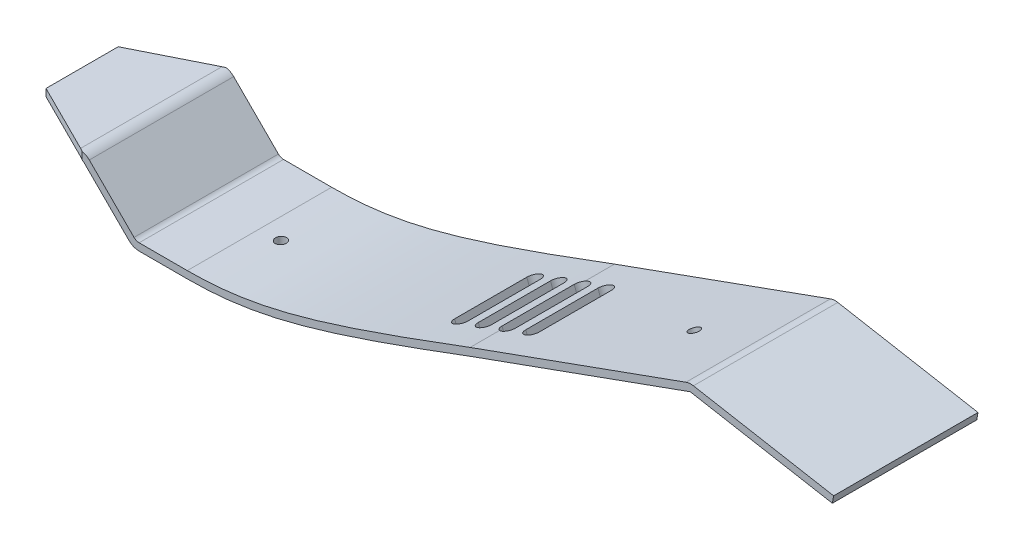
ISO-10303-21;
HEADER;
FILE_DESCRIPTION(('STEP AP214'),'2;1');
FILE_NAME('part.step','',(''),(''),'','','');
FILE_SCHEMA(('AUTOMOTIVE_DESIGN { 1 0 10303 214 1 1 1 1 }'));
ENDSEC;
DATA;
#1=APPLICATION_CONTEXT('core data for automotive mechanical design processes');
#2=APPLICATION_PROTOCOL_DEFINITION('international standard','automotive_design',2000,#1);
#3=PRODUCT_CONTEXT('',#1,'mechanical');
#4=PRODUCT('Part','Part','',(#3));
#5=PRODUCT_RELATED_PRODUCT_CATEGORY('part','',(#4));
#6=PRODUCT_DEFINITION_FORMATION('','',#4);
#7=PRODUCT_DEFINITION_CONTEXT('part definition',#1,'design');
#8=PRODUCT_DEFINITION('design','',#6,#7);
#9=PRODUCT_DEFINITION_SHAPE('','',#8);
#10=(LENGTH_UNIT() NAMED_UNIT(*) SI_UNIT(.MILLI.,.METRE.));
#11=(NAMED_UNIT(*) PLANE_ANGLE_UNIT() SI_UNIT($,.RADIAN.));
#12=(NAMED_UNIT(*) SI_UNIT($,.STERADIAN.) SOLID_ANGLE_UNIT());
#13=UNCERTAINTY_MEASURE_WITH_UNIT(LENGTH_MEASURE(1.E-05),#10,'distance_accuracy_value','');
#14=(GEOMETRIC_REPRESENTATION_CONTEXT(3) GLOBAL_UNCERTAINTY_ASSIGNED_CONTEXT((#13)) GLOBAL_UNIT_ASSIGNED_CONTEXT((#10,
#11,#12)) REPRESENTATION_CONTEXT('',''));
#15=CARTESIAN_POINT('',(0.,0.,0.));
#16=DIRECTION('',(0.,0.,1.));
#17=DIRECTION('',(1.,0.,0.));
#18=AXIS2_PLACEMENT_3D('',#15,#16,#17);
#19=CARTESIAN_POINT('',(-128.62337084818,4.00088906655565,40.));
#20=DIRECTION('',(1.,0.,0.));
#21=DIRECTION('',(0.,0.,-1.));
#22=AXIS2_PLACEMENT_3D('',#19,#20,#21);
#23=PLANE('',#22);
#24=DIRECTION('',(0.,0.,-1.));
#25=VECTOR('',#24,1.);
#26=CARTESIAN_POINT('',(-128.62337084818,4.00088906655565,40.));
#27=LINE('',#26,#25);
#28=CARTESIAN_POINT('',(-128.62337084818,4.00088906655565,30.));
#29=VERTEX_POINT('',#28);
#30=CARTESIAN_POINT('',(-128.62337084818,4.00088906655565,10.));
#31=VERTEX_POINT('',#30);
#32=EDGE_CURVE('E472',#29,#31,#27,.T.);
#33=ORIENTED_EDGE('',*,*,#32,.F.);
#34=DIRECTION('',(0.,1.,0.));
#35=VECTOR('',#34,1.);
#36=CARTESIAN_POINT('',(-128.62337084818,-10.1469254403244,30.));
#37=LINE('',#36,#35);
#38=CARTESIAN_POINT('',(-128.62337084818,6.00088906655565,30.));
#39=VERTEX_POINT('',#38);
#40=EDGE_CURVE('E508',#29,#39,#37,.T.);
#41=ORIENTED_EDGE('',*,*,#40,.T.);
#42=DIRECTION('',(0.,0.,-1.));
#43=VECTOR('',#42,1.);
#44=CARTESIAN_POINT('',(-128.62337084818,6.00088906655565,40.));
#45=LINE('',#44,#43);
#46=CARTESIAN_POINT('',(-128.62337084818,6.00088906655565,10.));
#47=VERTEX_POINT('',#46);
#48=EDGE_CURVE('E419',#39,#47,#45,.T.);
#49=ORIENTED_EDGE('',*,*,#48,.T.);
#50=DIRECTION('',(0.,1.,0.));
#51=VECTOR('',#50,1.);
#52=CARTESIAN_POINT('',(-128.62337084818,-10.1469254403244,10.));
#53=LINE('',#52,#51);
#54=EDGE_CURVE('E523',#31,#47,#53,.T.);
#55=ORIENTED_EDGE('',*,*,#54,.F.);
#56=EDGE_LOOP('',(#33,#41,#49,#55));
#57=FACE_BOUND('',#56,.T.);
#58=ADVANCED_FACE('F31',(#57),#23,.F.);
#59=CARTESIAN_POINT('',(-128.62337084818,4.00088906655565,40.));
#60=DIRECTION('',(0.,1.,0.));
#61=DIRECTION('',(-1.,0.,0.));
#62=AXIS2_PLACEMENT_3D('',#59,#60,#61);
#63=PLANE('',#62);
#64=DIRECTION('',(0.,0.,-1.));
#65=VECTOR('',#64,1.);
#66=CARTESIAN_POINT('',(-109.451797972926,4.00088906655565,40.));
#67=LINE('',#66,#65);
#68=CARTESIAN_POINT('',(-109.451797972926,4.00088906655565,39.5857864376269));
#69=VERTEX_POINT('',#68);
#70=CARTESIAN_POINT('',(-109.451797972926,4.00088906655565,0.41421356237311));
#71=VERTEX_POINT('',#70);
#72=EDGE_CURVE('E470',#69,#71,#67,.T.);
#73=ORIENTED_EDGE('',*,*,#72,.F.);
#74=DIRECTION('',(-0.894427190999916,0.,-0.447213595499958));
#75=VECTOR('',#74,1.);
#76=CARTESIAN_POINT('',(-124.62337084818,4.00088906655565,32.));
#77=LINE('',#76,#75);
#78=EDGE_CURVE('E517',#69,#29,#77,.T.);
#79=ORIENTED_EDGE('',*,*,#78,.T.);
#80=ORIENTED_EDGE('',*,*,#32,.T.);
#81=DIRECTION('',(0.894427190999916,0.,-0.447213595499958));
#82=VECTOR('',#81,1.);
#83=CARTESIAN_POINT('',(-140.62337084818,4.00088906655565,16.));
#84=LINE('',#83,#82);
#85=EDGE_CURVE('E532',#31,#71,#84,.T.);
#86=ORIENTED_EDGE('',*,*,#85,.T.);
#87=EDGE_LOOP('',(#73,#79,#80,#86));
#88=FACE_BOUND('',#87,.T.);
#89=ADVANCED_FACE('F707',(#88),#63,.F.);
#90=CARTESIAN_POINT('',(-109.451797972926,2.00088906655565,40.));
#91=DIRECTION('',(0.,0.,-1.));
#92=DIRECTION('',(-1.,0.,0.));
#93=AXIS2_PLACEMENT_3D('',#90,#91,#92);
#94=CYLINDRICAL_SURFACE('',#93,2.);
#95=CARTESIAN_POINT('',(-109.451797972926,2.00088906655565,40.));
#96=DIRECTION('',(0.,0.,-1.));
#97=DIRECTION('',(-1.,0.,0.));
#98=AXIS2_PLACEMENT_3D('',#95,#96,#97);
#99=CIRCLE('',#98,2.);
#100=CARTESIAN_POINT('',(-108.62337084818,3.82124850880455,40.));
#101=VERTEX_POINT('',#100);
#102=CARTESIAN_POINT('',(-108.037584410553,3.41510262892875,40.));
#103=VERTEX_POINT('',#102);
#104=EDGE_CURVE('E580',#101,#103,#99,.T.);
#105=ORIENTED_EDGE('',*,*,#104,.F.);
#106=CARTESIAN_POINT('',(-109.451797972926,2.00088906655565,39.5857864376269));
#107=DIRECTION('',(0.447213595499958,0.,-0.894427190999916));
#108=DIRECTION('',(-0.894427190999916,0.,-0.447213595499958));
#109=AXIS2_PLACEMENT_3D('',#106,#107,#108);
#110=ELLIPSE('',#109,2.23606797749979,2.);
#111=EDGE_CURVE('E514',#101,#69,#110,.F.);
#112=ORIENTED_EDGE('',*,*,#111,.T.);
#113=ORIENTED_EDGE('',*,*,#72,.T.);
#114=CARTESIAN_POINT('',(-109.451797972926,2.00088906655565,0.41421356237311));
#115=DIRECTION('',(0.447213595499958,0.,0.894427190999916));
#116=DIRECTION('',(0.894427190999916,0.,-0.447213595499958));
#117=AXIS2_PLACEMENT_3D('',#114,#115,#116);
#118=ELLIPSE('',#117,2.23606797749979,2.);
#119=CARTESIAN_POINT('',(-108.62337084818,3.82124850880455,0.));
#120=VERTEX_POINT('',#119);
#121=EDGE_CURVE('E529',#71,#120,#118,.F.);
#122=ORIENTED_EDGE('',*,*,#121,.T.);
#123=CARTESIAN_POINT('',(-109.451797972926,2.00088906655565,0.));
#124=DIRECTION('',(0.,0.,-1.));
#125=DIRECTION('',(-1.,0.,0.));
#126=AXIS2_PLACEMENT_3D('',#123,#124,#125);
#127=CIRCLE('',#126,2.);
#128=CARTESIAN_POINT('',(-108.037584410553,3.41510262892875,0.));
#129=VERTEX_POINT('',#128);
#130=EDGE_CURVE('E535',#120,#129,#127,.T.);
#131=ORIENTED_EDGE('',*,*,#130,.T.);
#132=DIRECTION('',(0.,0.,-1.));
#133=VECTOR('',#132,1.);
#134=CARTESIAN_POINT('',(-108.037584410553,3.41510262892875,40.));
#135=LINE('',#134,#133);
#136=EDGE_CURVE('E467',#103,#129,#135,.T.);
#137=ORIENTED_EDGE('',*,*,#136,.F.);
#138=EDGE_LOOP('',(#105,#112,#113,#122,#131,#137));
#139=FACE_BOUND('',#138,.T.);
#140=ADVANCED_FACE('F641',(#139),#94,.F.);
#141=CARTESIAN_POINT('',(-108.037584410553,3.41510262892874,40.));
#142=DIRECTION('',(0.707106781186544,0.707106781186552,0.));
#143=DIRECTION('',(-0.707106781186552,0.707106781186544,0.));
#144=AXIS2_PLACEMENT_3D('',#141,#142,#143);
#145=PLANE('',#144);
#146=DIRECTION('',(0.707106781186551,-0.707106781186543,0.));
#147=VECTOR('',#146,1.);
#148=CARTESIAN_POINT('',(-108.037584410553,3.41510262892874,0.));
#149=LINE('',#148,#147);
#150=CARTESIAN_POINT('',(-95.6528080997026,-8.96967368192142,0.));
#151=VERTEX_POINT('',#150);
#152=EDGE_CURVE('E537',#129,#151,#149,.T.);
#153=ORIENTED_EDGE('',*,*,#152,.T.);
#154=DIRECTION('',(0.,0.,-1.));
#155=VECTOR('',#154,1.);
#156=CARTESIAN_POINT('',(-95.6528080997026,-8.96967368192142,40.));
#157=LINE('',#156,#155);
#158=CARTESIAN_POINT('',(-95.6528080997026,-8.96967368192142,40.));
#159=VERTEX_POINT('',#158);
#160=EDGE_CURVE('E464',#159,#151,#157,.T.);
#161=ORIENTED_EDGE('',*,*,#160,.F.);
#162=DIRECTION('',(0.707106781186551,-0.707106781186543,0.));
#163=VECTOR('',#162,1.);
#164=CARTESIAN_POINT('',(-108.037584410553,3.41510262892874,40.));
#165=LINE('',#164,#163);
#166=EDGE_CURVE('E582',#103,#159,#165,.T.);
#167=ORIENTED_EDGE('',*,*,#166,.F.);
#168=ORIENTED_EDGE('',*,*,#136,.T.);
#169=EDGE_LOOP('',(#153,#161,#167,#168));
#170=FACE_BOUND('',#169,.T.);
#171=ADVANCED_FACE('F648',(#170),#145,.F.);
#172=CARTESIAN_POINT('',(-92.8243809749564,-6.14124655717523,40.));
#173=DIRECTION('',(0.,0.,-1.));
#174=DIRECTION('',(-1.,0.,0.));
#175=AXIS2_PLACEMENT_3D('',#172,#173,#174);
#176=CYLINDRICAL_SURFACE('',#175,4.);
#177=CARTESIAN_POINT('',(-92.8243809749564,-6.14124655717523,0.));
#178=DIRECTION('',(0.,0.,1.));
#179=DIRECTION('',(1.,0.,0.));
#180=AXIS2_PLACEMENT_3D('',#177,#178,#179);
#181=CIRCLE('',#180,4.);
#182=CARTESIAN_POINT('',(-92.8243809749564,-10.1412465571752,0.));
#183=VERTEX_POINT('',#182);
#184=EDGE_CURVE('E539',#151,#183,#181,.T.);
#185=ORIENTED_EDGE('',*,*,#184,.T.);
#186=DIRECTION('',(0.,0.,-1.));
#187=VECTOR('',#186,1.);
#188=CARTESIAN_POINT('',(-92.8243809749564,-10.1412465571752,40.));
#189=LINE('',#188,#187);
#190=CARTESIAN_POINT('',(-92.8243809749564,-10.1412465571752,40.));
#191=VERTEX_POINT('',#190);
#192=EDGE_CURVE('E461',#191,#183,#189,.T.);
#193=ORIENTED_EDGE('',*,*,#192,.F.);
#194=CARTESIAN_POINT('',(-92.8243809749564,-6.14124655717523,40.));
#195=DIRECTION('',(0.,0.,1.));
#196=DIRECTION('',(1.,0.,0.));
#197=AXIS2_PLACEMENT_3D('',#194,#195,#196);
#198=CIRCLE('',#197,4.);
#199=EDGE_CURVE('E584',#159,#191,#198,.T.);
#200=ORIENTED_EDGE('',*,*,#199,.F.);
#201=ORIENTED_EDGE('',*,*,#160,.T.);
#202=EDGE_LOOP('',(#185,#193,#200,#201));
#203=FACE_BOUND('',#202,.T.);
#204=ADVANCED_FACE('F654',(#203),#176,.T.);
#205=CARTESIAN_POINT('',(-92.8243809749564,-10.1412465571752,40.));
#206=DIRECTION('',(0.,1.,0.));
#207=DIRECTION('',(0.,0.,1.));
#208=AXIS2_PLACEMENT_3D('',#205,#206,#207);
#209=PLANE('',#208);
#210=DIRECTION('',(1.,0.,0.));
#211=VECTOR('',#210,1.);
#212=CARTESIAN_POINT('',(-92.8243809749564,-10.1412465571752,0.));
#213=LINE('',#212,#211);
#214=CARTESIAN_POINT('',(-79.4812352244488,-10.1412465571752,0.));
#215=VERTEX_POINT('',#214);
#216=EDGE_CURVE('E541',#183,#215,#213,.T.);
#217=ORIENTED_EDGE('',*,*,#216,.T.);
#218=DIRECTION('',(0.,0.,-1.));
#219=VECTOR('',#218,1.);
#220=CARTESIAN_POINT('',(-79.4812352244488,-10.1412465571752,40.));
#221=LINE('',#220,#219);
#222=CARTESIAN_POINT('',(-79.4812352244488,-10.1412465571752,40.));
#223=VERTEX_POINT('',#222);
#224=EDGE_CURVE('E458',#223,#215,#221,.T.);
#225=ORIENTED_EDGE('',*,*,#224,.F.);
#226=DIRECTION('',(1.,0.,0.));
#227=VECTOR('',#226,1.);
#228=CARTESIAN_POINT('',(-92.8243809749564,-10.1412465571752,40.));
#229=LINE('',#228,#227);
#230=EDGE_CURVE('E586',#191,#223,#229,.T.);
#231=ORIENTED_EDGE('',*,*,#230,.F.);
#232=ORIENTED_EDGE('',*,*,#192,.T.);
#233=EDGE_LOOP('',(#217,#225,#231,#232));
#234=FACE_BOUND('',#233,.T.);
#235=ADVANCED_FACE('F658',(#234),#209,.F.);
#236=CARTESIAN_POINT('',(-79.4812352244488,-10.1412465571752,40.));
#237=CARTESIAN_POINT('',(-59.2202180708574,-10.1526043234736,40.));
#238=CARTESIAN_POINT('',(-40.9191015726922,-4.41507017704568,40.));
#239=CARTESIAN_POINT('',(-0.42869893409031,10.7253801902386,40.));
#240=B_SPLINE_CURVE_WITH_KNOTS('',3,(#236,#237,#238,#239),.UNSPECIFIED.,.F.,.F.,(4,4),(0.,1.),.UNSPECIFIED.);
#241=DIRECTION('',(0.,0.,-1.));
#242=VECTOR('',#241,1.);
#243=SURFACE_OF_LINEAR_EXTRUSION('',#240,#242);
#244=DIRECTION('',(0.,0.,-1.));
#245=VECTOR('',#244,1.);
#246=CARTESIAN_POINT('',(-14.7332668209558,5.44001574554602,40.));
#247=LINE('',#246,#245);
#248=CARTESIAN_POINT('',(-14.7332668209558,5.44001574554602,10.));
#249=VERTEX_POINT('',#248);
#250=CARTESIAN_POINT('',(-14.7332668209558,5.44001574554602,30.));
#251=VERTEX_POINT('',#250);
#252=EDGE_CURVE('E301',#249,#251,#247,.F.);
#253=ORIENTED_EDGE('',*,*,#252,.T.);
#254=CARTESIAN_POINT('',(-14.7332668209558,5.44001574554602,30.));
#255=CARTESIAN_POINT('',(-14.7332664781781,5.4400158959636,30.0562678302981));
#256=CARTESIAN_POINT('',(-14.731033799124,5.44082767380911,30.1125087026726));
#257=CARTESIAN_POINT('',(-14.7221267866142,5.44406633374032,30.2245880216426));
#258=CARTESIAN_POINT('',(-14.7154526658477,5.44649313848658,30.2804264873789));
#259=CARTESIAN_POINT('',(-14.6888307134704,5.4561736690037,30.4466465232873));
#260=CARTESIAN_POINT('',(-14.6622831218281,5.465827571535,30.5559146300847));
#261=CARTESIAN_POINT('',(-14.5923272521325,5.49127152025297,30.7681523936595));
#262=CARTESIAN_POINT('',(-14.5489111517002,5.50706441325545,30.8711191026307));
#263=CARTESIAN_POINT('',(-14.4464586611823,5.54434179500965,31.0678297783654));
#264=CARTESIAN_POINT('',(-14.3874253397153,5.56582516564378,31.1615755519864));
#265=CARTESIAN_POINT('',(-14.2554123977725,5.6138823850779,31.3371890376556));
#266=CARTESIAN_POINT('',(-14.1824324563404,5.64045635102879,31.4190564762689));
#267=CARTESIAN_POINT('',(-14.0245888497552,5.69795227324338,31.5686038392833));
#268=CARTESIAN_POINT('',(-13.9397233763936,5.72887489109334,31.6362816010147));
#269=CARTESIAN_POINT('',(-13.7605329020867,5.79419280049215,31.7555085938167));
#270=CARTESIAN_POINT('',(-13.6662082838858,5.82858795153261,31.8070584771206));
#271=CARTESIAN_POINT('',(-13.4707828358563,5.89987895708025,31.8925678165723));
#272=CARTESIAN_POINT('',(-13.3696824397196,5.93677465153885,31.9265283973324));
#273=CARTESIAN_POINT('',(-13.1635680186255,6.01202635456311,31.9759005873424));
#274=CARTESIAN_POINT('',(-13.0585538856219,6.05038240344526,31.9913116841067));
#275=CARTESIAN_POINT('',(-12.8475946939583,6.12746704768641,32.0031469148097));
#276=CARTESIAN_POINT('',(-12.7416496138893,6.16619565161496,31.9995706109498));
#277=CARTESIAN_POINT('',(-12.5318343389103,6.24292553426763,31.9735281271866));
#278=CARTESIAN_POINT('',(-12.4279641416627,6.28092681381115,31.9510619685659));
#279=CARTESIAN_POINT('',(-12.2252604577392,6.35511480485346,31.8878907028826));
#280=CARTESIAN_POINT('',(-12.1264269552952,6.39130152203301,31.8471856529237));
#281=CARTESIAN_POINT('',(-11.936543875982,6.46084884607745,31.74864190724));
#282=CARTESIAN_POINT('',(-11.8454945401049,6.49420936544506,31.6908026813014));
#283=CARTESIAN_POINT('',(-11.7168315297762,6.5413656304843,31.5925497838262));
#284=CARTESIAN_POINT('',(-11.6752556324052,6.55660610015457,31.5578759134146));
#285=CARTESIAN_POINT('',(-11.5949499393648,6.58604790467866,31.4848918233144));
#286=CARTESIAN_POINT('',(-11.5562229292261,6.60024822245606,31.4465781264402));
#287=CARTESIAN_POINT('',(-11.4448583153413,6.64108838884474,31.326669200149));
#288=CARTESIAN_POINT('',(-11.3769213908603,6.66600987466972,31.2400175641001));
#289=CARTESIAN_POINT('',(-11.2556949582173,6.71048825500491,31.0557829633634));
#290=CARTESIAN_POINT('',(-11.2024048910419,6.73004535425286,30.9582004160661));
#291=CARTESIAN_POINT('',(-11.1345654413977,6.75494531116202,30.805766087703));
#292=CARTESIAN_POINT('',(-11.1139532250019,6.76251152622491,30.7538878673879));
#293=CARTESIAN_POINT('',(-11.0769180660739,6.77610697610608,30.6484945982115));
#294=CARTESIAN_POINT('',(-11.0604917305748,6.7821374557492,30.5949809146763));
#295=CARTESIAN_POINT('',(-11.0319471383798,6.79261727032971,30.4867272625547));
#296=CARTESIAN_POINT('',(-11.0198246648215,6.79706815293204,30.4319885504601));
#297=CARTESIAN_POINT('',(-10.9999511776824,6.80436509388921,30.321628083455));
#298=CARTESIAN_POINT('',(-10.9921988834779,6.80721162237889,30.2660065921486));
#299=CARTESIAN_POINT('',(-10.9831937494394,6.81051821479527,30.175220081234));
#300=CARTESIAN_POINT('',(-10.9805939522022,6.81147284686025,30.140200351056));
#301=CARTESIAN_POINT('',(-10.9771310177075,6.81274442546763,30.0701216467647));
#302=CARTESIAN_POINT('',(-10.9762650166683,6.8130624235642,30.0350628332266));
#303=CARTESIAN_POINT('',(-10.9762653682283,6.8130622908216,30.));
#304=B_SPLINE_CURVE_WITH_KNOTS('',3,(#254,#255,#256,#257,#258,#259,#260,#261,#262,#263,#264,
#265,#266,#267,#268,#269,#270,#271,#272,#273,#274,#275,#276,#277,#278,#279,#280,#281,#282,#283,
#284,#285,#286,#287,#288,#289,#290,#291,#292,#293,#294,#295,#296,#297,#298,#299,#300,#301,#302,
#303),.UNSPECIFIED.,.F.,.F.,(4,2,2,2,2,2,2,2,2,2,2,2,2,2,2,2,2,2,2,2,2,2,2,2,4),(0.,
0.168699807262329,0.337391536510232,0.67423624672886,1.01123734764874,1.34817228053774,
1.68511496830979,2.02210897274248,2.35908934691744,2.69604817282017,3.03301630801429,
3.36999221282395,3.70696773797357,4.04394220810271,4.38092710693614,4.54947984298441,
4.71819525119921,5.05517656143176,5.39214500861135,5.56097815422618,5.72967400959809,
5.89820412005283,6.06668481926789,6.17202733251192,6.27719570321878),.UNSPECIFIED.);
#305=CARTESIAN_POINT('',(-10.9762653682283,6.81306229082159,30.));
#306=VERTEX_POINT('',#305);
#307=EDGE_CURVE('E294',#251,#306,#304,.T.);
#308=ORIENTED_EDGE('',*,*,#307,.T.);
#309=DIRECTION('',(0.,0.,-1.));
#310=VECTOR('',#309,1.);
#311=CARTESIAN_POINT('',(-10.9762653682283,6.8130622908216,40.));
#312=LINE('',#311,#310);
#313=CARTESIAN_POINT('',(-10.9762653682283,6.8130622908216,10.));
#314=VERTEX_POINT('',#313);
#315=EDGE_CURVE('E283',#306,#314,#312,.T.);
#316=ORIENTED_EDGE('',*,*,#315,.T.);
#317=CARTESIAN_POINT('',(-10.9762653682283,6.81306229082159,10.));
#318=CARTESIAN_POINT('',(-10.9762657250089,6.8130621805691,9.94373265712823));
#319=CARTESIAN_POINT('',(-10.9784957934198,6.81224327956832,9.88749227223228));
#320=CARTESIAN_POINT('',(-10.9873924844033,6.80897647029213,9.77541393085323));
#321=CARTESIAN_POINT('',(-10.9940588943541,6.80652864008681,9.7195759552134));
#322=CARTESIAN_POINT('',(-11.0206503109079,6.79676490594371,9.55335744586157));
#323=CARTESIAN_POINT('',(-11.0471676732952,6.78702869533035,9.44409037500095));
#324=CARTESIAN_POINT('',(-11.1170466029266,6.76137563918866,9.23185465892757));
#325=CARTESIAN_POINT('',(-11.160415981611,6.74545592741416,9.12888896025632));
#326=CARTESIAN_POINT('',(-11.2627637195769,6.70789482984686,8.93218012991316));
#327=CARTESIAN_POINT('',(-11.3217390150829,6.68625456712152,8.8384351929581));
#328=CARTESIAN_POINT('',(-11.4536315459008,6.63787101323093,8.66282235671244));
#329=CARTESIAN_POINT('',(-11.5265492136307,6.61112756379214,8.58095482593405));
#330=CARTESIAN_POINT('',(-11.6842705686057,6.5532993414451,8.43140702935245));
#331=CARTESIAN_POINT('',(-11.7690760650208,6.522213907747,8.36372892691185));
#332=CARTESIAN_POINT('',(-11.9481567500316,6.45659501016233,8.2445001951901));
#333=CARTESIAN_POINT('',(-12.0424316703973,6.42206164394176,8.19294910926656));
#334=CARTESIAN_POINT('',(-12.2377727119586,6.35053469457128,8.1074374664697));
#335=CARTESIAN_POINT('',(-12.3388383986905,6.31354126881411,8.07347578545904));
#336=CARTESIAN_POINT('',(-12.5449025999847,6.23814545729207,8.02410155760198));
#337=CARTESIAN_POINT('',(-12.6499012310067,6.19974302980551,8.00868956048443));
#338=CARTESIAN_POINT('',(-12.8608502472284,6.12262224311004,7.99685297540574));
#339=CARTESIAN_POINT('',(-12.966800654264,6.08390387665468,8.00042882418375));
#340=CARTESIAN_POINT('',(-13.1766457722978,6.00725032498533,8.02647085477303));
#341=CARTESIAN_POINT('',(-13.2805405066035,5.96931513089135,8.04893682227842));
#342=CARTESIAN_POINT('',(-13.4833107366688,5.8953073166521,8.11210801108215));
#343=CARTESIAN_POINT('',(-13.5821862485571,5.85923469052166,8.15281317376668));
#344=CARTESIAN_POINT('',(-13.7721648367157,5.7899513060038,8.25135683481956));
#345=CARTESIAN_POINT('',(-13.8632677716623,5.75674059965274,8.30919564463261));
#346=CARTESIAN_POINT('',(-13.9920161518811,5.70982256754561,8.4074478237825));
#347=CARTESIAN_POINT('',(-14.033621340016,5.69466377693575,8.4421214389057));
#348=CARTESIAN_POINT('',(-14.1139864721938,5.66538763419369,8.51510497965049));
#349=CARTESIAN_POINT('',(-14.1527436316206,5.65127130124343,8.55341838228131));
#350=CARTESIAN_POINT('',(-14.264198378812,5.6106828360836,8.67332610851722));
#351=CARTESIAN_POINT('',(-14.3321953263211,5.58592893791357,8.75997672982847));
#352=CARTESIAN_POINT('',(-14.4535350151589,5.54176614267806,8.9442090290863));
#353=CARTESIAN_POINT('',(-14.5068783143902,5.52235704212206,9.04179029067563));
#354=CARTESIAN_POINT('',(-14.5747883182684,5.49765185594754,9.1942229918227));
#355=CARTESIAN_POINT('',(-14.5954225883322,5.49014605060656,9.24610097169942));
#356=CARTESIAN_POINT('',(-14.6324980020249,5.47666067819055,9.35149374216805));
#357=CARTESIAN_POINT('',(-14.6489425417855,5.47067987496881,9.40500716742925));
#358=CARTESIAN_POINT('',(-14.6775191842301,5.46028723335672,9.51326030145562));
#359=CARTESIAN_POINT('',(-14.6896555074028,5.45587385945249,9.56799875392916));
#360=CARTESIAN_POINT('',(-14.7095519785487,5.44863875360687,9.67835870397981));
#361=CARTESIAN_POINT('',(-14.7173134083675,5.44581655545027,9.73397993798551));
#362=CARTESIAN_POINT('',(-14.7263296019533,5.44253815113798,9.82476846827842));
#363=CARTESIAN_POINT('',(-14.7289327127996,5.44159164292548,9.85979048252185));
#364=CARTESIAN_POINT('',(-14.7324000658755,5.44033089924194,9.92987376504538));
#365=CARTESIAN_POINT('',(-14.7332671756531,5.44001562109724,9.96493487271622));
#366=CARTESIAN_POINT('',(-14.7332668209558,5.44001574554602,10.));
#367=B_SPLINE_CURVE_WITH_KNOTS('',3,(#317,#318,#319,#320,#321,#322,#323,#324,#325,#326,#327,
#328,#329,#330,#331,#332,#333,#334,#335,#336,#337,#338,#339,#340,#341,#342,#343,#344,#345,#346,
#347,#348,#349,#350,#351,#352,#353,#354,#355,#356,#357,#358,#359,#360,#361,#362,#363,#364,#365,
#366),.UNSPECIFIED.,.F.,.F.,(4,2,2,2,2,2,2,2,2,2,2,2,2,2,2,2,2,2,2,2,2,2,2,2,4),(0.,
0.168698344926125,0.337388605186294,0.674230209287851,1.01122813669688,1.34815995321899,
1.68510222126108,2.02209582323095,2.35907988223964,2.69604240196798,3.03301490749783,
3.36999516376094,3.70697159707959,4.04394694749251,4.38092842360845,4.54947944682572,
4.71819313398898,5.0551699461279,5.3921339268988,5.56096638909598,5.72966155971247,
5.89819101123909,6.06667105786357,6.17202047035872,6.27719572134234),.UNSPECIFIED.);
#368=EDGE_CURVE('E288',#314,#249,#367,.T.);
#369=ORIENTED_EDGE('',*,*,#368,.T.);
#370=EDGE_LOOP('',(#253,#308,#316,#369));
#371=FACE_BOUND('',#370,.T.);
#372=DIRECTION('',(0.,0.,-1.));
#373=VECTOR('',#372,1.);
#374=CARTESIAN_POINT('',(-8.16109816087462,7.85001612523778,40.));
#375=LINE('',#374,#373);
#376=CARTESIAN_POINT('',(-8.16109816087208,7.85001612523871,10.));
#377=VERTEX_POINT('',#376);
#378=CARTESIAN_POINT('',(-8.16109816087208,7.85001612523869,30.));
#379=VERTEX_POINT('',#378);
#380=EDGE_CURVE('E354',#377,#379,#375,.F.);
#381=ORIENTED_EDGE('',*,*,#380,.T.);
#382=CARTESIAN_POINT('',(-8.16109816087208,7.85001612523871,30.));
#383=CARTESIAN_POINT('',(-8.16109781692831,7.85001626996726,30.0562666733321));
#384=CARTESIAN_POINT('',(-8.15886937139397,7.85083950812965,30.1125063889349));
#385=CARTESIAN_POINT('',(-8.1499792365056,7.85412383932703,30.2245833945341));
#386=CARTESIAN_POINT('',(-8.14331775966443,7.85658485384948,30.2804207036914));
#387=CARTESIAN_POINT('',(-8.11674622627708,7.86640171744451,30.4466371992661));
#388=CARTESIAN_POINT('',(-8.0902488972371,7.87619144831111,30.5559029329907));
#389=CARTESIAN_POINT('',(-8.02042514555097,7.90199191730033,30.7681360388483));
#390=CARTESIAN_POINT('',(-7.97709091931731,7.91800554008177,30.8711004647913));
#391=CARTESIAN_POINT('',(-7.87483091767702,7.95580102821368,31.0678068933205));
#392=CARTESIAN_POINT('',(-7.81590820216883,7.97758176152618,31.1615507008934));
#393=CARTESIAN_POINT('',(-7.6841406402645,8.02629989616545,31.3371618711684));
#394=CARTESIAN_POINT('',(-7.61129531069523,8.05323747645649,31.4190288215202));
#395=CARTESIAN_POINT('',(-7.45374099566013,8.11151393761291,31.5685758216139));
#396=CARTESIAN_POINT('',(-7.36903020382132,8.14285348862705,31.6362537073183));
#397=CARTESIAN_POINT('',(-7.19016152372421,8.20904530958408,31.7554835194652));
#398=CARTESIAN_POINT('',(-7.0960037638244,8.24389753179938,31.8070356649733));
#399=CARTESIAN_POINT('',(-6.90092094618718,8.31612718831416,31.892549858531));
#400=CARTESIAN_POINT('',(-6.79999632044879,8.35350446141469,31.9265130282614));
#401=CARTESIAN_POINT('',(-6.59423392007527,8.42973008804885,31.975891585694));
#402=CARTESIAN_POINT('',(-6.48939592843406,8.4685785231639,31.9913059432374));
#403=CARTESIAN_POINT('',(-6.27878690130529,8.54664327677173,32.0031471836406));
#404=CARTESIAN_POINT('',(-6.17301584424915,8.58585960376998,31.9995736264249));
#405=CARTESIAN_POINT('',(-5.96353985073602,8.66354738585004,31.9735358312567));
#406=CARTESIAN_POINT('',(-5.85983494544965,8.70201882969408,31.9510713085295));
#407=CARTESIAN_POINT('',(-5.65745052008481,8.77711654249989,31.8879019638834));
#408=CARTESIAN_POINT('',(-5.55877098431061,8.81374281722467,31.8471971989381));
#409=CARTESIAN_POINT('',(-5.36918130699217,8.88412783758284,31.7486527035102));
#410=CARTESIAN_POINT('',(-5.27827137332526,8.91788650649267,31.6908125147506));
#411=CARTESIAN_POINT('',(-5.14980376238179,8.9656014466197,31.5925570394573));
#412=CARTESIAN_POINT('',(-5.10829072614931,8.98102174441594,31.5578821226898));
#413=CARTESIAN_POINT('',(-5.02810600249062,9.010809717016,31.484895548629));
#414=CARTESIAN_POINT('',(-4.98943709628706,9.02517636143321,31.4465804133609));
#415=CARTESIAN_POINT('',(-4.87824080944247,9.06649265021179,31.3266684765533));
#416=CARTESIAN_POINT('',(-4.81040625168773,9.09170233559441,31.2400150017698));
#417=CARTESIAN_POINT('',(-4.68936171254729,9.13669248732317,31.0557757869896));
#418=CARTESIAN_POINT('',(-4.63615116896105,9.15647316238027,30.9581904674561));
#419=CARTESIAN_POINT('',(-4.56841369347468,9.18165637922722,30.805753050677));
#420=CARTESIAN_POINT('',(-4.54783283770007,9.18930830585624,30.7538748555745));
#421=CARTESIAN_POINT('',(-4.51085398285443,9.20305751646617,30.6484815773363));
#422=CARTESIAN_POINT('',(-4.49445259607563,9.20915605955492,30.5949678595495));
#423=CARTESIAN_POINT('',(-4.46595139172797,9.21975399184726,30.4867141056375));
#424=CARTESIAN_POINT('',(-4.45384736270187,9.22425494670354,30.4319753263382));
#425=CARTESIAN_POINT('',(-4.4340042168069,9.23163387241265,30.3216147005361));
#426=CARTESIAN_POINT('',(-4.42626382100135,9.23451231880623,30.265993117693));
#427=CARTESIAN_POINT('',(-4.41727290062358,9.23785582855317,30.1752087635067));
#428=CARTESIAN_POINT('',(-4.4146773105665,9.23882107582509,30.1401912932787));
#429=CARTESIAN_POINT('',(-4.41121997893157,9.24010679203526,30.0701171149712));
#430=CARTESIAN_POINT('',(-4.41035537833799,9.24042832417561,30.035060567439));
#431=CARTESIAN_POINT('',(-4.41035572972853,9.24042819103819,30.));
#432=B_SPLINE_CURVE_WITH_KNOTS('',3,(#382,#383,#384,#385,#386,#387,#388,#389,#390,#391,#392,
#393,#394,#395,#396,#397,#398,#399,#400,#401,#402,#403,#404,#405,#406,#407,#408,#409,#410,#411,
#412,#413,#414,#415,#416,#417,#418,#419,#420,#421,#422,#423,#424,#425,#426,#427,#428,#429,#430,
#431),.UNSPECIFIED.,.F.,.F.,(4,2,2,2,2,2,2,2,2,2,2,2,2,2,2,2,2,2,2,2,2,2,2,2,4),(0.,
0.168696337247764,0.337384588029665,0.674222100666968,1.01121591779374,1.34814363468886,
1.68508304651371,2.02207380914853,2.35905999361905,2.69602468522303,3.03300809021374,
3.36999930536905,3.70699560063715,4.04399084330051,4.38099509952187,4.5495574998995,
4.71828260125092,5.05527530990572,5.3922550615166,5.56108846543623,5.72978458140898,
5.89831491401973,6.06679582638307,6.17213152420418,6.27729309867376),.UNSPECIFIED.);
#433=CARTESIAN_POINT('',(-4.41035572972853,9.24042819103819,30.));
#434=VERTEX_POINT('',#433);
#435=EDGE_CURVE('E358',#379,#434,#432,.T.);
#436=ORIENTED_EDGE('',*,*,#435,.T.);
#437=DIRECTION('',(0.,0.,-1.));
#438=VECTOR('',#437,1.);
#439=CARTESIAN_POINT('',(-4.41035572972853,9.24042819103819,40.));
#440=LINE('',#439,#438);
#441=CARTESIAN_POINT('',(-4.41035572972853,9.24042819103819,10.));
#442=VERTEX_POINT('',#441);
#443=EDGE_CURVE('E355',#434,#442,#440,.T.);
#444=ORIENTED_EDGE('',*,*,#443,.T.);
#445=CARTESIAN_POINT('',(-4.41035572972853,9.24042819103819,10.));
#446=CARTESIAN_POINT('',(-4.41035608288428,9.24042807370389,9.94373400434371));
#447=CARTESIAN_POINT('',(-4.4125827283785,9.23960000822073,9.88749496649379));
#448=CARTESIAN_POINT('',(-4.42146574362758,9.23629660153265,9.77541932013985));
#449=CARTESIAN_POINT('',(-4.42812190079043,9.23382133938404,9.71958269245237));
#450=CARTESIAN_POINT('',(-4.45467235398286,9.22394809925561,9.55336832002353));
#451=CARTESIAN_POINT('',(-4.48114880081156,9.21410260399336,9.44410402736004));
#452=CARTESIAN_POINT('',(-4.55091931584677,9.18816049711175,9.23187377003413));
#453=CARTESIAN_POINT('',(-4.59422117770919,9.17206098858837,9.12891074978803));
#454=CARTESIAN_POINT('',(-4.69640847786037,9.13407341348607,8.93220688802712));
#455=CARTESIAN_POINT('',(-4.75529086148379,9.11218648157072,8.83846424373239));
#456=CARTESIAN_POINT('',(-4.88697490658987,9.06324738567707,8.66285397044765));
#457=CARTESIAN_POINT('',(-4.95977720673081,9.03619498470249,8.58098688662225));
#458=CARTESIAN_POINT('',(-5.11724695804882,8.97769343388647,8.43143927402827));
#459=CARTESIAN_POINT('',(-5.20191621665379,8.94624361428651,8.36376091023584));
#460=CARTESIAN_POINT('',(-5.38070952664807,8.87984768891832,8.24452868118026));
#461=CARTESIAN_POINT('',(-5.47483360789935,8.84490157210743,8.19297486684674));
#462=CARTESIAN_POINT('',(-5.66985949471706,8.77251152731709,8.10745747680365));
#463=CARTESIAN_POINT('',(-5.77076086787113,8.73506775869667,8.07349278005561));
#464=CARTESIAN_POINT('',(-5.97649021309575,8.65874385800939,8.02411139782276));
#465=CARTESIAN_POINT('',(-6.08131841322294,8.61986364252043,8.00869579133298));
#466=CARTESIAN_POINT('',(-6.29192226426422,8.54177367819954,7.99685266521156));
#467=CARTESIAN_POINT('',(-6.39769793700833,8.50256392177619,8.00042558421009));
#468=CARTESIAN_POINT('',(-6.60719562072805,8.42492743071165,8.02646273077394));
#469=CARTESIAN_POINT('',(-6.71091762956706,8.3865006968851,8.04892697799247));
#470=CARTESIAN_POINT('',(-6.91334823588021,8.31152496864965,8.11209619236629));
#471=CARTESIAN_POINT('',(-7.01205684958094,8.27497596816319,8.15280110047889));
#472=CARTESIAN_POINT('',(-7.20171164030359,8.20477010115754,8.25134546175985));
#473=CARTESIAN_POINT('',(-7.2926577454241,8.17111326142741,8.30918507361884));
#474=CARTESIAN_POINT('',(-7.42118305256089,8.12356022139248,8.4074395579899));
#475=CARTESIAN_POINT('',(-7.46271589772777,8.1081954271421,8.4421141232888));
#476=CARTESIAN_POINT('',(-7.54294083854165,8.07852002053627,8.51509994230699));
#477=CARTESIAN_POINT('',(-7.58163015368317,8.06421043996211,8.55341467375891));
#478=CARTESIAN_POINT('',(-7.69288730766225,8.02306522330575,8.67332495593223));
#479=CARTESIAN_POINT('',(-7.7607624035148,7.99796943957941,8.7599770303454));
#480=CARTESIAN_POINT('',(-7.8818835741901,7.95319372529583,8.94421307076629));
#481=CARTESIAN_POINT('',(-7.93513020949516,7.93351358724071,9.04179661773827));
#482=CARTESIAN_POINT('',(-8.00291582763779,7.90846256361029,9.19423178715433));
#483=CARTESIAN_POINT('',(-8.02351183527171,7.90085159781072,9.24610964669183));
#484=CARTESIAN_POINT('',(-8.0605183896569,7.887177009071,9.35150222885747));
#485=CARTESIAN_POINT('',(-8.07693232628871,7.8811121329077,9.4050155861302));
#486=CARTESIAN_POINT('',(-8.10545569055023,7.87057325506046,9.51326861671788));
#487=CARTESIAN_POINT('',(-8.1175693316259,7.86609769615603,9.56800703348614));
#488=CARTESIAN_POINT('',(-8.13742852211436,7.85876060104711,9.6783669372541));
#489=CARTESIAN_POINT('',(-8.1451753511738,7.85589859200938,9.73398816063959));
#490=CARTESIAN_POINT('',(-8.15417434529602,7.852574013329,9.82477532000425));
#491=CARTESIAN_POINT('',(-8.15677242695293,7.85161419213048,9.85979596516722));
#492=CARTESIAN_POINT('',(-8.16023308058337,7.85033571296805,9.92987650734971));
#493=CARTESIAN_POINT('',(-8.16109851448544,7.85001599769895,9.96493624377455));
#494=CARTESIAN_POINT('',(-8.16109816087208,7.85001612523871,10.));
#495=B_SPLINE_CURVE_WITH_KNOTS('',3,(#445,#446,#447,#448,#449,#450,#451,#452,#453,#454,#455,
#456,#457,#458,#459,#460,#461,#462,#463,#464,#465,#466,#467,#468,#469,#470,#471,#472,#473,#474,
#475,#476,#477,#478,#479,#480,#481,#482,#483,#484,#485,#486,#487,#488,#489,#490,#491,#492,#493,
#494),.UNSPECIFIED.,.F.,.F.,(4,2,2,2,2,2,2,2,2,2,2,2,2,2,2,2,2,2,2,2,2,2,2,2,4),(0.,
0.16869430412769,0.337380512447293,0.674213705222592,1.01120310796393,1.34812649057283,
1.68506533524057,2.02205555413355,2.3590468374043,2.69601663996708,3.03300604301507,
3.37000323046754,3.70700076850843,4.0439972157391,4.38099678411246,4.54955683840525,
4.71827958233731,5.05526608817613,5.39223968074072,5.56107212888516,5.72976728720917,
5.89829669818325,6.06677669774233,6.17212198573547,6.27729312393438),.UNSPECIFIED.);
#496=EDGE_CURVE('E347',#442,#377,#495,.T.);
#497=ORIENTED_EDGE('',*,*,#496,.T.);
#498=EDGE_LOOP('',(#381,#436,#444,#497));
#499=FACE_BOUND('',#498,.T.);
#500=CARTESIAN_POINT('',(-73.5429534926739,-9.97463398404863,21.5));
#501=CARTESIAN_POINT('',(-73.4585432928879,-9.96979134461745,21.4999942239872));
#502=CARTESIAN_POINT('',(-73.3740510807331,-9.96483582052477,21.4928414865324));
#503=CARTESIAN_POINT('',(-73.2492026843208,-9.95735798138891,21.4715655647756));
#504=CARTESIAN_POINT('',(-73.2078681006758,-9.9548558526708,21.4627040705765));
#505=CARTESIAN_POINT('',(-73.1260522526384,-9.94985344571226,21.4415197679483));
#506=CARTESIAN_POINT('',(-73.0855717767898,-9.94735317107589,21.429193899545));
#507=CARTESIAN_POINT('',(-72.9660128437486,-9.93989723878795,21.3871768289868));
#508=CARTESIAN_POINT('',(-72.8886537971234,-9.9349766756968,21.3524181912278));
#509=CARTESIAN_POINT('',(-72.740877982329,-9.92541845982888,21.2703611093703));
#510=CARTESIAN_POINT('',(-72.6704612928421,-9.92078081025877,21.2230625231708));
#511=CARTESIAN_POINT('',(-72.5715860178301,-9.91417651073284,21.1437818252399));
#512=CARTESIAN_POINT('',(-72.539738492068,-9.9120328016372,21.1159503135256));
#513=CARTESIAN_POINT('',(-72.4785285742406,-9.90788548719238,21.0577251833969));
#514=CARTESIAN_POINT('',(-72.4491638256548,-9.90588174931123,21.0273340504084));
#515=CARTESIAN_POINT('',(-72.3650566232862,-9.90010859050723,20.9325663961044));
#516=CARTESIAN_POINT('',(-72.3142758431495,-9.89657551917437,20.8645752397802));
#517=CARTESIAN_POINT('',(-72.2249770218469,-9.89030997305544,20.7211589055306));
#518=CARTESIAN_POINT('',(-72.18643638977,-9.88757602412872,20.6457477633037));
#519=CARTESIAN_POINT('',(-72.1225592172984,-9.88302013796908,20.4894893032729));
#520=CARTESIAN_POINT('',(-72.0972224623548,-9.8811981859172,20.4086420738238));
#521=CARTESIAN_POINT('',(-72.0605394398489,-9.87855395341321,20.2440189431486));
#522=CARTESIAN_POINT('',(-72.0491606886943,-9.87772935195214,20.1602503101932));
#523=CARTESIAN_POINT('',(-72.0406114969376,-9.8771101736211,19.991987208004));
#524=CARTESIAN_POINT('',(-72.0434408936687,-9.87731558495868,19.9074927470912));
#525=CARTESIAN_POINT('',(-72.0632135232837,-9.87874594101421,19.7402940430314));
#526=CARTESIAN_POINT('',(-72.0801382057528,-9.87996954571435,19.6575875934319));
#527=CARTESIAN_POINT('',(-72.1275896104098,-9.88337806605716,19.4961945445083));
#528=CARTESIAN_POINT('',(-72.1581163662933,-9.88556298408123,19.417507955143));
#529=CARTESIAN_POINT('',(-72.2319196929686,-9.89079672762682,19.2663309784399));
#530=CARTESIAN_POINT('',(-72.2752042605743,-9.89384609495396,19.193844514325));
#531=CARTESIAN_POINT('',(-72.3732795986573,-9.90067355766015,19.0571647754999));
#532=CARTESIAN_POINT('',(-72.4280704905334,-9.90445166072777,18.9929715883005));
#533=CARTESIAN_POINT('',(-72.5477294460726,-9.91258472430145,18.8745537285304));
#534=CARTESIAN_POINT('',(-72.6126186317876,-9.91694089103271,18.8203504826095));
#535=CARTESIAN_POINT('',(-72.7505485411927,-9.92604703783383,18.7236023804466));
#536=CARTESIAN_POINT('',(-72.8235893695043,-9.93079702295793,18.6810576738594));
#537=CARTESIAN_POINT('',(-72.9759248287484,-9.94052020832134,18.6087405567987));
#538=CARTESIAN_POINT('',(-73.0552327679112,-9.94549387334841,18.5789962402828));
#539=CARTESIAN_POINT('',(-73.217716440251,-9.95547818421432,18.5332538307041));
#540=CARTESIAN_POINT('',(-73.3008921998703,-9.96048883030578,18.5172558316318));
#541=CARTESIAN_POINT('',(-73.4688410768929,-9.97039016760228,18.4994516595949));
#542=CARTESIAN_POINT('',(-73.5536157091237,-9.97528073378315,18.4976597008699));
#543=CARTESIAN_POINT('',(-73.722273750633,-9.98479563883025,18.5083618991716));
#544=CARTESIAN_POINT('',(-73.8061571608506,-9.98941997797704,18.5208560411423));
#545=CARTESIAN_POINT('',(-73.9706107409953,-9.99828497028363,18.5597756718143));
#546=CARTESIAN_POINT('',(-74.0511823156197,-10.0025257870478,18.5861951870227));
#547=CARTESIAN_POINT('',(-74.2067535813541,-10.0105374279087,18.6522204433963));
#548=CARTESIAN_POINT('',(-74.2817533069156,-10.0143082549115,18.6918261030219));
#549=CARTESIAN_POINT('',(-74.4239495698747,-10.0213128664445,18.7830479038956));
#550=CARTESIAN_POINT('',(-74.4911556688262,-10.0245473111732,18.8346490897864));
#551=CARTESIAN_POINT('',(-74.6159522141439,-10.0304448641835,18.948428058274));
#552=CARTESIAN_POINT('',(-74.6735427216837,-10.0331079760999,19.0106057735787));
#553=CARTESIAN_POINT('',(-74.7773937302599,-10.0378376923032,19.1436868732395));
#554=CARTESIAN_POINT('',(-74.8236685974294,-10.0399050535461,19.2145790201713));
#555=CARTESIAN_POINT('',(-74.9036611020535,-10.043438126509,19.3631389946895));
#556=CARTESIAN_POINT('',(-74.9373788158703,-10.0449038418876,19.4408067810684));
#557=CARTESIAN_POINT('',(-74.9912688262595,-10.0472300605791,19.6006393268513));
#558=CARTESIAN_POINT('',(-75.0114530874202,-10.0480910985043,19.6828000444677));
#559=CARTESIAN_POINT('',(-75.0377482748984,-10.0492104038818,19.8493469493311));
#560=CARTESIAN_POINT('',(-75.0438592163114,-10.0494686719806,19.9337331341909));
#561=CARTESIAN_POINT('',(-75.0418313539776,-10.0493827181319,20.1023008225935));
#562=CARTESIAN_POINT('',(-75.0336985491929,-10.0490387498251,20.1864823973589));
#563=CARTESIAN_POINT('',(-75.0034354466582,-10.0477487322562,20.3522746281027));
#564=CARTESIAN_POINT('',(-74.981305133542,-10.046802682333,20.4338852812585));
#565=CARTESIAN_POINT('',(-74.9236462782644,-10.0443069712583,20.5922670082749));
#566=CARTESIAN_POINT('',(-74.8881175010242,-10.0427572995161,20.669037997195));
#567=CARTESIAN_POINT('',(-74.8256169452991,-10.0399860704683,20.7788161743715));
#568=CARTESIAN_POINT('',(-74.8032438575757,-10.0389876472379,20.8145186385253));
#569=CARTESIAN_POINT('',(-74.7555573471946,-10.0368415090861,20.8839495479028));
#570=CARTESIAN_POINT('',(-74.7302411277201,-10.0356936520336,20.917676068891));
#571=CARTESIAN_POINT('',(-74.6501774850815,-10.0320298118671,21.0154501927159));
#572=CARTESIAN_POINT('',(-74.5912760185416,-10.0292918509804,21.0761608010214));
#573=CARTESIAN_POINT('',(-74.4641327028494,-10.0232505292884,21.1868157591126));
#574=CARTESIAN_POINT('',(-74.3958909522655,-10.0199471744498,21.2367602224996));
#575=CARTESIAN_POINT('',(-74.2879883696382,-10.014600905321,21.3025778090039));
#576=CARTESIAN_POINT('',(-74.2510416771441,-10.0127507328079,21.3230227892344));
#577=CARTESIAN_POINT('',(-74.1756009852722,-10.0089293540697,21.3607111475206));
#578=CARTESIAN_POINT('',(-74.1371083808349,-10.0069582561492,21.3779573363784));
#579=CARTESIAN_POINT('',(-74.0197142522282,-10.0008760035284,21.424700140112));
#580=CARTESIAN_POINT('',(-73.938777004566,-9.9965900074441,21.4492736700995));
#581=CARTESIAN_POINT('',(-73.8049462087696,-9.98933322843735,21.4778851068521));
#582=CARTESIAN_POINT('',(-73.7528991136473,-9.98647085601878,21.4861669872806));
#583=CARTESIAN_POINT('',(-73.6482298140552,-9.98063162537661,21.4972262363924));
#584=CARTESIAN_POINT('',(-73.5956076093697,-9.97765476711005,21.5000036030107));
#585=CARTESIAN_POINT('',(-73.5429534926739,-9.97463398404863,21.5));
#586=B_SPLINE_CURVE_WITH_KNOTS('',3,(#500,#501,#502,#503,#504,#505,#506,#507,#508,#509,#510,
#511,#512,#513,#514,#515,#516,#517,#518,#519,#520,#521,#522,#523,#524,#525,#526,#527,#528,#529,
#530,#531,#532,#533,#534,#535,#536,#537,#538,#539,#540,#541,#542,#543,#544,#545,#546,#547,#548,
#549,#550,#551,#552,#553,#554,#555,#556,#557,#558,#559,#560,#561,#562,#563,#564,#565,#566,#567,
#568,#569,#570,#571,#572,#573,#574,#575,#576,#577,#578,#579,#580,#581,#582,#583,#584,#585),
.UNSPECIFIED.,.T.,.F.,(4,2,2,2,2,2,2,2,2,2,2,2,2,2,2,2,2,2,2,2,2,2,2,2,2,2,2,2,2,2,2,2,2,2,2,2,
2,2,2,2,2,2,4),(0.,0.253421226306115,0.380342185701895,0.507375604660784,0.760951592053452,
1.01453045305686,1.14144532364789,1.26823834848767,1.52172788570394,1.7747468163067,
2.02776163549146,2.28018650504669,2.53260848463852,2.78469878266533,3.03678970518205,
3.28903897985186,3.54129091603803,3.79407774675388,4.04686782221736,4.3002099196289,
4.55355374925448,4.80715103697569,5.06074805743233,5.31423638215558,5.56772313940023,
5.82089554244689,6.07406633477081,6.32691401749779,6.57976016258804,6.8323824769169,
7.08500452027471,7.33752019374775,7.59003614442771,7.84255652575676,7.96886357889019,
8.09529165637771,8.34791437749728,8.60053443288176,8.72720099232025,8.85375571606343,
9.10645057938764,9.26453178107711,9.42261304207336),.UNSPECIFIED.);
#587=CARTESIAN_POINT('',(-73.5429534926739,-9.97463398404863,21.5));
#588=VERTEX_POINT('',#587);
#589=EDGE_CURVE('E485',#588,#588,#586,.T.);
#590=ORIENTED_EDGE('',*,*,#589,.T.);
#591=EDGE_LOOP('',(#590));
#592=FACE_BOUND('',#591,.T.);
#593=DIRECTION('',(0.,0.,-1.));
#594=VECTOR('',#593,1.);
#595=CARTESIAN_POINT('',(-1.59904204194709,10.2880735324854,40.));
#596=LINE('',#595,#594);
#597=CARTESIAN_POINT('',(-1.59904204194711,10.2880735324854,10.));
#598=VERTEX_POINT('',#597);
#599=CARTESIAN_POINT('',(-1.59904204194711,10.2880735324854,30.));
#600=VERTEX_POINT('',#599);
#601=EDGE_CURVE('E721',#598,#600,#596,.F.);
#602=ORIENTED_EDGE('',*,*,#601,.T.);
#603=CARTESIAN_POINT('',(-1.59904204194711,10.2880735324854,30.));
#604=CARTESIAN_POINT('',(-1.59904167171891,10.2880736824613,30.0562664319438));
#605=CARTESIAN_POINT('',(-1.59681605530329,10.2889046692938,30.1125058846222));
#606=CARTESIAN_POINT('',(-1.58793717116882,10.2922198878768,30.224582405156));
#607=CARTESIAN_POINT('',(-1.58128411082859,10.2947040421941,30.2804194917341));
#608=CARTESIAN_POINT('',(-1.5547467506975,10.3046128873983,30.4466306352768));
#609=CARTESIAN_POINT('',(-1.52828409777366,10.3144940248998,30.5558913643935));
#610=CARTESIAN_POINT('',(-1.45855549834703,10.3405328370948,30.7681069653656));
#611=CARTESIAN_POINT('',(-1.41528292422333,10.3566929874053,30.8710593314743));
#612=CARTESIAN_POINT('',(-1.31315618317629,10.3948366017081,31.0677633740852));
#613=CARTESIAN_POINT('',(-1.25430228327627,10.4168199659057,31.1615152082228));
#614=CARTESIAN_POINT('',(-1.12267527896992,10.4659927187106,31.3371668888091));
#615=CARTESIAN_POINT('',(-1.0498965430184,10.4931842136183,31.4190619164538));
#616=CARTESIAN_POINT('',(-0.89250224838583,10.5519990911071,31.5686107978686));
#617=CARTESIAN_POINT('',(-0.807895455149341,10.583619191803,31.6362751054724));
#618=CARTESIAN_POINT('',(-0.672542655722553,10.6342134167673,31.7266218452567));
#619=CARTESIAN_POINT('',(-0.625186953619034,10.6519162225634,31.7552421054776));
#620=CARTESIAN_POINT('',(-0.528420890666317,10.6880931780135,31.8079319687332));
#621=CARTESIAN_POINT('',(-0.479014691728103,10.7065657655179,31.8320102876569));
#622=CARTESIAN_POINT('',(-0.42869893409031,10.7253801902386,31.853762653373));
#623=B_SPLINE_CURVE_WITH_KNOTS('',3,(#603,#604,#605,#606,#607,#608,#609,#610,#611,#612,#613,
#614,#615,#616,#617,#618,#619,#620,#621,#622),.UNSPECIFIED.,.F.,.F.,(4,2,2,2,2,2,2,2,2,4),(0.,
0.168695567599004,0.337383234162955,0.674205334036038,1.01116036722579,1.34810962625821,
1.68519544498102,2.02203277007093,2.1961268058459,2.36988328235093),.UNSPECIFIED.);
#624=CARTESIAN_POINT('',(-0.428698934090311,10.7253801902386,31.853762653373));
#625=VERTEX_POINT('',#624);
#626=EDGE_CURVE('E765',#600,#625,#623,.T.);
#627=ORIENTED_EDGE('',*,*,#626,.T.);
#628=DIRECTION('',(0.,0.,-1.));
#629=VECTOR('',#628,1.);
#630=CARTESIAN_POINT('',(-0.42869893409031,10.7253801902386,40.));
#631=LINE('',#630,#629);
#632=CARTESIAN_POINT('',(-0.42869893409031,10.7253801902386,40.));
#633=VERTEX_POINT('',#632);
#634=EDGE_CURVE('E455',#633,#625,#631,.T.);
#635=ORIENTED_EDGE('',*,*,#634,.F.);
#636=EDGE_CURVE('E587',#223,#633,#240,.T.);
#637=ORIENTED_EDGE('',*,*,#636,.F.);
#638=ORIENTED_EDGE('',*,*,#224,.T.);
#639=CARTESIAN_POINT('',(-79.4812352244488,-10.1412465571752,0.));
#640=CARTESIAN_POINT('',(-59.2202180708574,-10.1526043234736,0.));
#641=CARTESIAN_POINT('',(-40.9191015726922,-4.41507017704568,0.));
#642=CARTESIAN_POINT('',(-0.42869893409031,10.7253801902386,0.));
#643=B_SPLINE_CURVE_WITH_KNOTS('',3,(#639,#640,#641,#642),.UNSPECIFIED.,.F.,.F.,(4,4),(0.,1.),.UNSPECIFIED.);
#644=CARTESIAN_POINT('',(-0.42869893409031,10.7253801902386,0.));
#645=VERTEX_POINT('',#644);
#646=EDGE_CURVE('E543',#215,#645,#643,.T.);
#647=ORIENTED_EDGE('',*,*,#646,.T.);
#648=CARTESIAN_POINT('',(-0.428698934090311,10.7253801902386,8.14623734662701));
#649=VERTEX_POINT('',#648);
#650=EDGE_CURVE('E454',#649,#645,#631,.T.);
#651=ORIENTED_EDGE('',*,*,#650,.F.);
#652=CARTESIAN_POINT('',(-0.42869893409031,10.7253801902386,8.14623734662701));
#653=CARTESIAN_POINT('',(-0.477553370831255,10.7071121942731,8.16735852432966));
#654=CARTESIAN_POINT('',(-0.525549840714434,10.6891666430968,8.19067128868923));
#655=CARTESIAN_POINT('',(-0.619532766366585,10.6540300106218,8.24152674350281));
#656=CARTESIAN_POINT('',(-0.665519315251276,10.6368388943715,8.26906923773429));
#657=CARTESIAN_POINT('',(-0.799883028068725,10.5866138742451,8.35771795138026));
#658=CARTESIAN_POINT('',(-0.88482596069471,10.5548678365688,8.42491550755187));
#659=CARTESIAN_POINT('',(-1.04293194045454,10.495786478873,8.57357190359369));
#660=CARTESIAN_POINT('',(-1.11609029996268,10.4684529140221,8.65503639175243));
#661=CARTESIAN_POINT('',(-1.24856901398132,10.4189615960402,8.82993244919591));
#662=CARTESIAN_POINT('',(-1.30788962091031,10.3968037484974,8.92336380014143));
#663=CARTESIAN_POINT('',(-1.41100776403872,10.3582896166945,9.11954717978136));
#664=CARTESIAN_POINT('',(-1.45480017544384,10.3419352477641,9.22230227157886));
#665=CARTESIAN_POINT('',(-1.52557255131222,10.3155065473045,9.43418290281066));
#666=CARTESIAN_POINT('',(-1.55256491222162,10.3054275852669,9.54330367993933));
#667=CARTESIAN_POINT('',(-1.58019372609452,10.2951111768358,9.71112622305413));
#668=CARTESIAN_POINT('',(-1.58726317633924,10.2924715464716,9.76870031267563));
#669=CARTESIAN_POINT('',(-1.59668283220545,10.2889544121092,9.8841742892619));
#670=CARTESIAN_POINT('',(-1.59904215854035,10.2880735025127,9.94207332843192));
#671=CARTESIAN_POINT('',(-1.5990420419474,10.2880735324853,9.99999999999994));
#672=B_SPLINE_CURVE_WITH_KNOTS('',3,(#652,#653,#654,#655,#656,#657,#658,#659,#660,#661,#662,
#663,#664,#665,#666,#667,#668,#669,#670,#671),.UNSPECIFIED.,.F.,.F.,(4,2,2,2,2,2,2,2,2,4),(0.,
0.168713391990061,0.337418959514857,0.674278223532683,1.01127115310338,1.34825793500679,
1.6853558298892,2.0222046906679,2.19621244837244,2.36988292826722),.UNSPECIFIED.);
#673=EDGE_CURVE('E710',#649,#598,#672,.T.);
#674=ORIENTED_EDGE('',*,*,#673,.T.);
#675=EDGE_LOOP('',(#602,#627,#635,#637,#638,#647,#651,#674));
#676=FACE_BOUND('',#675,.T.);
#677=ADVANCED_FACE('F299',(#371,#499,#592,#676),#243,.F.);
#678=CARTESIAN_POINT('',(59.8648149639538,32.4568569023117,40.));
#679=DIRECTION('',(-0.339075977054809,0.940758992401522,0.));
#680=DIRECTION('',(-0.940758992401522,-0.339075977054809,0.));
#681=AXIS2_PLACEMENT_3D('',#678,#679,#680);
#682=PLANE('',#681);
#683=ORIENTED_EDGE('',*,*,#634,.T.);
#684=CARTESIAN_POINT('',(0.277537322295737,10.9799275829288,30.));
#685=DIRECTION('',(-0.339075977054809,0.940758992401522,0.));
#686=DIRECTION('',(-0.940758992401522,-0.339075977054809,0.));
#687=AXIS2_PLACEMENT_3D('',#684,#685,#686);
#688=CIRCLE('',#687,2.);
#689=CARTESIAN_POINT('',(2.15905530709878,11.6580795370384,30.));
#690=VERTEX_POINT('',#689);
#691=EDGE_CURVE('E771',#625,#690,#688,.T.);
#692=ORIENTED_EDGE('',*,*,#691,.T.);
#693=DIRECTION('',(0.,0.,-1.));
#694=VECTOR('',#693,1.);
#695=CARTESIAN_POINT('',(2.15905530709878,11.6580795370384,40.));
#696=LINE('',#695,#694);
#697=CARTESIAN_POINT('',(2.15905530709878,11.6580795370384,10.));
#698=VERTEX_POINT('',#697);
#699=EDGE_CURVE('E716',#690,#698,#696,.T.);
#700=ORIENTED_EDGE('',*,*,#699,.T.);
#701=CARTESIAN_POINT('',(0.277537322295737,10.9799275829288,10.));
#702=DIRECTION('',(-0.339075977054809,0.940758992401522,0.));
#703=DIRECTION('',(-0.940758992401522,-0.339075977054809,0.));
#704=AXIS2_PLACEMENT_3D('',#701,#702,#703);
#705=CIRCLE('',#704,2.);
#706=EDGE_CURVE('E714',#698,#649,#705,.T.);
#707=ORIENTED_EDGE('',*,*,#706,.T.);
#708=ORIENTED_EDGE('',*,*,#650,.T.);
#709=DIRECTION('',(0.940758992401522,0.339075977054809,0.));
#710=VECTOR('',#709,1.);
#711=CARTESIAN_POINT('',(59.8648149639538,32.4568569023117,0.));
#712=LINE('',#711,#710);
#713=CARTESIAN_POINT('',(59.8648149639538,32.4568569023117,0.));
#714=VERTEX_POINT('',#713);
#715=EDGE_CURVE('E548',#645,#714,#712,.T.);
#716=ORIENTED_EDGE('',*,*,#715,.T.);
#717=DIRECTION('',(0.,0.,-1.));
#718=VECTOR('',#717,1.);
#719=CARTESIAN_POINT('',(59.8648149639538,32.4568569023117,40.));
#720=LINE('',#719,#718);
#721=CARTESIAN_POINT('',(59.8648149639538,32.4568569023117,40.));
#722=VERTEX_POINT('',#721);
#723=EDGE_CURVE('E451',#722,#714,#720,.T.);
#724=ORIENTED_EDGE('',*,*,#723,.F.);
#725=DIRECTION('',(0.940758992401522,0.339075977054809,0.));
#726=VECTOR('',#725,1.);
#727=CARTESIAN_POINT('',(59.8648149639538,32.4568569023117,40.));
#728=LINE('',#727,#726);
#729=EDGE_CURVE('E592',#633,#722,#728,.T.);
#730=ORIENTED_EDGE('',*,*,#729,.F.);
#731=EDGE_LOOP('',(#683,#692,#700,#707,#708,#716,#724,#730));
#732=FACE_BOUND('',#731,.T.);
#733=DIRECTION('',(0.,0.,1.));
#734=VECTOR('',#733,1.);
#735=CARTESIAN_POINT('',(4.98133228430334,12.6753074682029,40.));
#736=LINE('',#735,#734);
#737=CARTESIAN_POINT('',(4.98133228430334,12.6753074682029,10.));
#738=VERTEX_POINT('',#737);
#739=CARTESIAN_POINT('',(4.98133228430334,12.6753074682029,30.));
#740=VERTEX_POINT('',#739);
#741=EDGE_CURVE('E790',#738,#740,#736,.T.);
#742=ORIENTED_EDGE('',*,*,#741,.T.);
#743=CARTESIAN_POINT('',(6.86285026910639,13.3534594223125,30.));
#744=DIRECTION('',(-0.339075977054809,0.940758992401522,0.));
#745=DIRECTION('',(-0.940758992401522,-0.339075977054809,0.));
#746=AXIS2_PLACEMENT_3D('',#743,#744,#745);
#747=CIRCLE('',#746,2.);
#748=CARTESIAN_POINT('',(8.74436825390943,14.0316113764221,30.));
#749=VERTEX_POINT('',#748);
#750=EDGE_CURVE('E793',#740,#749,#747,.T.);
#751=ORIENTED_EDGE('',*,*,#750,.T.);
#752=DIRECTION('',(0.,0.,-1.));
#753=VECTOR('',#752,1.);
#754=CARTESIAN_POINT('',(8.74436825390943,14.0316113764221,40.));
#755=LINE('',#754,#753);
#756=CARTESIAN_POINT('',(8.74436825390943,14.0316113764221,10.));
#757=VERTEX_POINT('',#756);
#758=EDGE_CURVE('E777',#749,#757,#755,.T.);
#759=ORIENTED_EDGE('',*,*,#758,.T.);
#760=CARTESIAN_POINT('',(6.86285026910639,13.3534594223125,10.));
#761=DIRECTION('',(-0.339075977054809,0.940758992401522,0.));
#762=DIRECTION('',(-0.940758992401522,-0.339075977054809,0.));
#763=AXIS2_PLACEMENT_3D('',#760,#761,#762);
#764=CIRCLE('',#763,2.);
#765=EDGE_CURVE('E787',#757,#738,#764,.T.);
#766=ORIENTED_EDGE('',*,*,#765,.T.);
#767=EDGE_LOOP('',(#742,#751,#759,#766));
#768=FACE_BOUND('',#767,.T.);
#769=CARTESIAN_POINT('',(41.6709329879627,25.8992705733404,20.));
#770=DIRECTION('',(-0.339075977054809,0.940758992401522,0.));
#771=DIRECTION('',(-0.940758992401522,-0.339075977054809,0.));
#772=AXIS2_PLACEMENT_3D('',#769,#770,#771);
#773=CIRCLE('',#772,1.5);
#774=CARTESIAN_POINT('',(40.2597944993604,25.3906566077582,20.));
#775=VERTEX_POINT('',#774);
#776=EDGE_CURVE('E486',#775,#775,#773,.T.);
#777=ORIENTED_EDGE('',*,*,#776,.T.);
#778=EDGE_LOOP('',(#777));
#779=FACE_BOUND('',#778,.T.);
#780=ADVANCED_FACE('F670',(#732,#768,#779),#682,.F.);
#781=CARTESIAN_POINT('',(99.2351819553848,25.3876134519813,40.));
#782=DIRECTION('',(0.176731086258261,0.984259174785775,0.));
#783=DIRECTION('',(-0.984259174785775,0.176731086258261,0.));
#784=AXIS2_PLACEMENT_3D('',#781,#782,#783);
#785=PLANE('',#784);
#786=DIRECTION('',(0.984259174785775,-0.176731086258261,0.));
#787=VECTOR('',#786,1.);
#788=CARTESIAN_POINT('',(99.2351819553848,25.3876134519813,0.));
#789=LINE('',#788,#787);
#790=CARTESIAN_POINT('',(99.2351819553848,25.3876134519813,0.));
#791=VERTEX_POINT('',#790);
#792=EDGE_CURVE('E553',#714,#791,#789,.T.);
#793=ORIENTED_EDGE('',*,*,#792,.T.);
#794=DIRECTION('',(0.,0.,-1.));
#795=VECTOR('',#794,1.);
#796=CARTESIAN_POINT('',(99.2351819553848,25.3876134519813,40.));
#797=LINE('',#796,#795);
#798=CARTESIAN_POINT('',(99.2351819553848,25.3876134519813,40.));
#799=VERTEX_POINT('',#798);
#800=EDGE_CURVE('E448',#799,#791,#797,.T.);
#801=ORIENTED_EDGE('',*,*,#800,.F.);
#802=DIRECTION('',(0.984259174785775,-0.176731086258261,0.));
#803=VECTOR('',#802,1.);
#804=CARTESIAN_POINT('',(99.2351819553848,25.3876134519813,40.));
#805=LINE('',#804,#803);
#806=EDGE_CURVE('E597',#722,#799,#805,.T.);
#807=ORIENTED_EDGE('',*,*,#806,.F.);
#808=ORIENTED_EDGE('',*,*,#723,.T.);
#809=EDGE_LOOP('',(#793,#801,#807,#808));
#810=FACE_BOUND('',#809,.T.);
#811=ADVANCED_FACE('F675',(#810),#785,.F.);
#812=CARTESIAN_POINT('',(99.5886441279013,27.3561318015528,40.));
#813=DIRECTION('',(-0.984259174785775,0.176731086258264,0.));
#814=DIRECTION('',(-0.176731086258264,-0.984259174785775,0.));
#815=AXIS2_PLACEMENT_3D('',#812,#813,#814);
#816=PLANE('',#815);
#817=DIRECTION('',(0.176731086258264,0.984259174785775,0.));
#818=VECTOR('',#817,1.);
#819=CARTESIAN_POINT('',(99.5886441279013,27.3561318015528,0.));
#820=LINE('',#819,#818);
#821=CARTESIAN_POINT('',(99.5886441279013,27.3561318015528,0.));
#822=VERTEX_POINT('',#821);
#823=EDGE_CURVE('E555',#791,#822,#820,.T.);
#824=ORIENTED_EDGE('',*,*,#823,.T.);
#825=DIRECTION('',(0.,0.,-1.));
#826=VECTOR('',#825,1.);
#827=CARTESIAN_POINT('',(99.5886441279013,27.3561318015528,40.));
#828=LINE('',#827,#826);
#829=CARTESIAN_POINT('',(99.5886441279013,27.3561318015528,40.));
#830=VERTEX_POINT('',#829);
#831=EDGE_CURVE('E445',#830,#822,#828,.T.);
#832=ORIENTED_EDGE('',*,*,#831,.F.);
#833=DIRECTION('',(0.176731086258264,0.984259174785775,0.));
#834=VECTOR('',#833,1.);
#835=CARTESIAN_POINT('',(99.5886441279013,27.3561318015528,40.));
#836=LINE('',#835,#834);
#837=EDGE_CURVE('E599',#799,#830,#836,.T.);
#838=ORIENTED_EDGE('',*,*,#837,.F.);
#839=ORIENTED_EDGE('',*,*,#800,.T.);
#840=EDGE_LOOP('',(#824,#832,#838,#839));
#841=FACE_BOUND('',#840,.T.);
#842=ADVANCED_FACE('F680',(#841),#816,.F.);
#843=CARTESIAN_POINT('',(99.5886441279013,27.3561318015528,40.));
#844=DIRECTION('',(-0.176731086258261,-0.984259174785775,0.));
#845=DIRECTION('',(0.984259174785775,-0.176731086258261,0.));
#846=AXIS2_PLACEMENT_3D('',#843,#844,#845);
#847=PLANE('',#846);
#848=DIRECTION('',(-0.984259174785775,0.176731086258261,0.));
#849=VECTOR('',#848,1.);
#850=CARTESIAN_POINT('',(99.5886441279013,27.3561318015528,0.));
#851=LINE('',#850,#849);
#852=CARTESIAN_POINT('',(60.7457400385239,34.3306653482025,0.));
#853=VERTEX_POINT('',#852);
#854=EDGE_CURVE('E557',#822,#853,#851,.T.);
#855=ORIENTED_EDGE('',*,*,#854,.T.);
#856=DIRECTION('',(0.,0.,-1.));
#857=VECTOR('',#856,1.);
#858=CARTESIAN_POINT('',(60.7457400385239,34.3306653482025,40.));
#859=LINE('',#858,#857);
#860=CARTESIAN_POINT('',(60.7457400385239,34.3306653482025,40.));
#861=VERTEX_POINT('',#860);
#862=EDGE_CURVE('E442',#861,#853,#859,.T.);
#863=ORIENTED_EDGE('',*,*,#862,.F.);
#864=DIRECTION('',(-0.984259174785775,0.176731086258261,0.));
#865=VECTOR('',#864,1.);
#866=CARTESIAN_POINT('',(99.5886441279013,27.3561318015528,40.));
#867=LINE('',#866,#865);
#868=EDGE_CURVE('E601',#830,#861,#867,.T.);
#869=ORIENTED_EDGE('',*,*,#868,.F.);
#870=ORIENTED_EDGE('',*,*,#831,.T.);
#871=EDGE_LOOP('',(#855,#863,#869,#870));
#872=FACE_BOUND('',#871,.T.);
#873=ADVANCED_FACE('F684',(#872),#847,.F.);
#874=CARTESIAN_POINT('',(60.0388156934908,30.3936286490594,40.));
#875=DIRECTION('',(0.,0.,-1.));
#876=DIRECTION('',(-1.,0.,0.));
#877=AXIS2_PLACEMENT_3D('',#874,#875,#876);
#878=CYLINDRICAL_SURFACE('',#877,4.);
#879=CARTESIAN_POINT('',(60.0388156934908,30.3936286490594,0.));
#880=DIRECTION('',(0.,0.,1.));
#881=DIRECTION('',(-1.,0.,0.));
#882=AXIS2_PLACEMENT_3D('',#879,#880,#881);
#883=CIRCLE('',#882,4.);
#884=CARTESIAN_POINT('',(58.6825117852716,34.1566646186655,0.));
#885=VERTEX_POINT('',#884);
#886=EDGE_CURVE('E559',#853,#885,#883,.T.);
#887=ORIENTED_EDGE('',*,*,#886,.T.);
#888=DIRECTION('',(0.,0.,-1.));
#889=VECTOR('',#888,1.);
#890=CARTESIAN_POINT('',(58.6825117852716,34.1566646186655,40.));
#891=LINE('',#890,#889);
#892=CARTESIAN_POINT('',(58.6825117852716,34.1566646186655,40.));
#893=VERTEX_POINT('',#892);
#894=EDGE_CURVE('E439',#893,#885,#891,.T.);
#895=ORIENTED_EDGE('',*,*,#894,.F.);
#896=CARTESIAN_POINT('',(60.0388156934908,30.3936286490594,40.));
#897=DIRECTION('',(0.,0.,1.));
#898=DIRECTION('',(-1.,0.,0.));
#899=AXIS2_PLACEMENT_3D('',#896,#897,#898);
#900=CIRCLE('',#899,4.);
#901=EDGE_CURVE('E602',#861,#893,#900,.T.);
#902=ORIENTED_EDGE('',*,*,#901,.F.);
#903=ORIENTED_EDGE('',*,*,#862,.T.);
#904=EDGE_LOOP('',(#887,#895,#902,#903));
#905=FACE_BOUND('',#904,.T.);
#906=ADVANCED_FACE('F688',(#905),#878,.T.);
#907=CARTESIAN_POINT('',(58.6825117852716,34.1566646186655,40.));
#908=DIRECTION('',(0.33907597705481,-0.940758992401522,0.));
#909=DIRECTION('',(0.940758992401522,0.33907597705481,0.));
#910=AXIS2_PLACEMENT_3D('',#907,#908,#909);
#911=PLANE('',#910);
#912=DIRECTION('',(0.,0.,1.));
#913=VECTOR('',#912,1.);
#914=CARTESIAN_POINT('',(8.06621629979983,15.9131293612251,40.));
#915=LINE('',#914,#913);
#916=CARTESIAN_POINT('',(8.06621629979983,15.9131293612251,10.));
#917=VERTEX_POINT('',#916);
#918=CARTESIAN_POINT('',(8.06621629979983,15.9131293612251,30.));
#919=VERTEX_POINT('',#918);
#920=EDGE_CURVE('E478',#917,#919,#915,.T.);
#921=ORIENTED_EDGE('',*,*,#920,.T.);
#922=CARTESIAN_POINT('',(6.18469831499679,15.2349774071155,30.));
#923=DIRECTION('',(0.33907597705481,-0.940758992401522,0.));
#924=DIRECTION('',(0.940758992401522,0.33907597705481,0.));
#925=AXIS2_PLACEMENT_3D('',#922,#923,#924);
#926=CIRCLE('',#925,2.);
#927=CARTESIAN_POINT('',(4.30318033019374,14.5568254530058,30.));
#928=VERTEX_POINT('',#927);
#929=EDGE_CURVE('E746',#919,#928,#926,.T.);
#930=ORIENTED_EDGE('',*,*,#929,.T.);
#931=DIRECTION('',(0.,0.,-1.));
#932=VECTOR('',#931,1.);
#933=CARTESIAN_POINT('',(4.30318033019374,14.5568254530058,40.));
#934=LINE('',#933,#932);
#935=CARTESIAN_POINT('',(4.30318033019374,14.5568254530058,10.));
#936=VERTEX_POINT('',#935);
#937=EDGE_CURVE('E853',#928,#936,#934,.T.);
#938=ORIENTED_EDGE('',*,*,#937,.T.);
#939=CARTESIAN_POINT('',(6.18469831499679,15.2349774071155,10.));
#940=DIRECTION('',(0.33907597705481,-0.940758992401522,0.));
#941=DIRECTION('',(0.940758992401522,0.33907597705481,0.));
#942=AXIS2_PLACEMENT_3D('',#939,#940,#941);
#943=CIRCLE('',#942,2.);
#944=EDGE_CURVE('E851',#936,#917,#943,.T.);
#945=ORIENTED_EDGE('',*,*,#944,.T.);
#946=EDGE_LOOP('',(#921,#930,#938,#945));
#947=FACE_BOUND('',#946,.T.);
#948=CARTESIAN_POINT('',(40.9927810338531,27.7807885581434,20.));
#949=DIRECTION('',(-0.33907597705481,0.940758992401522,0.));
#950=DIRECTION('',(-0.940758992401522,-0.33907597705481,0.));
#951=AXIS2_PLACEMENT_3D('',#948,#949,#950);
#952=CIRCLE('',#951,1.5);
#953=CARTESIAN_POINT('',(39.5816425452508,27.2721745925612,20.));
#954=VERTEX_POINT('',#953);
#955=EDGE_CURVE('E795',#954,#954,#952,.T.);
#956=ORIENTED_EDGE('',*,*,#955,.F.);
#957=EDGE_LOOP('',(#956));
#958=FACE_BOUND('',#957,.T.);
#959=DIRECTION('',(0.,0.,1.));
#960=VECTOR('',#959,1.);
#961=CARTESIAN_POINT('',(1.48090335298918,13.5395975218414,40.));
#962=LINE('',#961,#960);
#963=CARTESIAN_POINT('',(1.48090335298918,13.5395975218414,10.));
#964=VERTEX_POINT('',#963);
#965=CARTESIAN_POINT('',(1.48090335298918,13.5395975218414,30.));
#966=VERTEX_POINT('',#965);
#967=EDGE_CURVE('E755',#964,#966,#962,.T.);
#968=ORIENTED_EDGE('',*,*,#967,.T.);
#969=CARTESIAN_POINT('',(-0.400614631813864,12.8614455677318,30.));
#970=DIRECTION('',(0.33907597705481,-0.940758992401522,0.));
#971=DIRECTION('',(0.940758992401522,0.33907597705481,0.));
#972=AXIS2_PLACEMENT_3D('',#969,#970,#971);
#973=CIRCLE('',#972,2.);
#974=CARTESIAN_POINT('',(-1.11804136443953,12.6028648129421,31.8489009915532));
#975=VERTEX_POINT('',#974);
#976=EDGE_CURVE('E614',#966,#975,#973,.T.);
#977=ORIENTED_EDGE('',*,*,#976,.T.);
#978=DIRECTION('',(0.,0.,-1.));
#979=VECTOR('',#978,1.);
#980=CARTESIAN_POINT('',(-1.11804136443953,12.6028648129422,40.));
#981=LINE('',#980,#979);
#982=CARTESIAN_POINT('',(-1.11804136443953,12.6028648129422,40.));
#983=VERTEX_POINT('',#982);
#984=EDGE_CURVE('E436',#983,#975,#981,.T.);
#985=ORIENTED_EDGE('',*,*,#984,.F.);
#986=DIRECTION('',(-0.940758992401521,-0.33907597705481,0.));
#987=VECTOR('',#986,1.);
#988=CARTESIAN_POINT('',(58.6825117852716,34.1566646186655,40.));
#989=LINE('',#988,#987);
#990=EDGE_CURVE('E406',#893,#983,#989,.T.);
#991=ORIENTED_EDGE('',*,*,#990,.F.);
#992=ORIENTED_EDGE('',*,*,#894,.T.);
#993=DIRECTION('',(-0.940758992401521,-0.33907597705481,0.));
#994=VECTOR('',#993,1.);
#995=CARTESIAN_POINT('',(58.6825117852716,34.1566646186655,0.));
#996=LINE('',#995,#994);
#997=CARTESIAN_POINT('',(-1.11804136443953,12.6028648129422,0.));
#998=VERTEX_POINT('',#997);
#999=EDGE_CURVE('E561',#885,#998,#996,.T.);
#1000=ORIENTED_EDGE('',*,*,#999,.T.);
#1001=CARTESIAN_POINT('',(-1.11804136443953,12.6028648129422,8.15109900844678));
#1002=VERTEX_POINT('',#1001);
#1003=EDGE_CURVE('E435',#1002,#998,#981,.T.);
#1004=ORIENTED_EDGE('',*,*,#1003,.F.);
#1005=CARTESIAN_POINT('',(-0.400614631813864,12.8614455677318,10.));
#1006=DIRECTION('',(0.33907597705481,-0.940758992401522,0.));
#1007=DIRECTION('',(0.940758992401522,0.33907597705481,0.));
#1008=AXIS2_PLACEMENT_3D('',#1005,#1006,#1007);
#1009=CIRCLE('',#1008,2.);
#1010=EDGE_CURVE('E719',#1002,#964,#1009,.T.);
#1011=ORIENTED_EDGE('',*,*,#1010,.T.);
#1012=EDGE_LOOP('',(#968,#977,#985,#991,#992,#1000,#1004,#1011));
#1013=FACE_BOUND('',#1012,.T.);
#1014=ADVANCED_FACE('F392',(#947,#958,#1013),#911,.F.);
#1015=CARTESIAN_POINT('',(-1.11804136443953,12.6028648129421,40.));
#1016=CARTESIAN_POINT('',(-1.74486245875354,12.3684795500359,40.));
#1017=CARTESIAN_POINT('',(-3.00661887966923,11.8972033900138,40.));
#1018=CARTESIAN_POINT('',(-5.46736894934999,10.9804521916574,40.));
#1019=CARTESIAN_POINT('',(-8.47119913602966,9.86613069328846,40.));
#1020=CARTESIAN_POINT('',(-11.9509155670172,8.58407574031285,40.));
#1021=CARTESIAN_POINT('',(-16.434763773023,6.9454645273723,40.));
#1022=CARTESIAN_POINT('',(-21.756112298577,5.02916364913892,40.));
#1023=CARTESIAN_POINT('',(-27.7236711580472,2.9352533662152,40.));
#1024=CARTESIAN_POINT('',(-33.3077015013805,1.04181040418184,40.));
#1025=CARTESIAN_POINT('',(-40.2880004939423,-1.22262185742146,40.));
#1026=CARTESIAN_POINT('',(-48.2282936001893,-3.57878746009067,40.));
#1027=CARTESIAN_POINT('',(-56.778199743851,-5.69217847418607,40.));
#1028=CARTESIAN_POINT('',(-67.257637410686,-7.62132988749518,40.));
#1029=CARTESIAN_POINT('',(-74.4964252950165,-8.14404058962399,40.));
#1030=CARTESIAN_POINT('',(-79.4806746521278,-8.14124655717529,40.));
#1031=B_SPLINE_CURVE_WITH_KNOTS('',3,(#1015,#1016,#1017,#1018,#1019,#1020,#1021,#1022,#1023,
#1024,#1025,#1026,#1027,#1028,#1029,#1030),.UNSPECIFIED.,.F.,.F.,(4,1,1,1,1,1,1,1,1,1,1,1,1,4),
(-9.22250888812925E-06,0.0156173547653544,0.0312439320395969,0.0624970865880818,
0.0937502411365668,0.125003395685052,0.187509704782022,0.250016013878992,0.312522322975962,
0.375028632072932,0.500041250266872,0.625053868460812,0.750066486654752,1.00009172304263),.UNSPECIFIED.);
#1032=DIRECTION('',(0.,0.,-1.));
#1033=VECTOR('',#1032,1.);
#1034=SURFACE_OF_LINEAR_EXTRUSION('',#1031,#1033);
#1035=DIRECTION('',(0.,0.,-1.));
#1036=VECTOR('',#1035,1.);
#1037=CARTESIAN_POINT('',(-11.6544294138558,8.6946138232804,40.));
#1038=LINE('',#1037,#1036);
#1039=CARTESIAN_POINT('',(-11.6544294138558,8.6946138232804,10.));
#1040=VERTEX_POINT('',#1039);
#1041=CARTESIAN_POINT('',(-11.6544294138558,8.6946138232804,30.));
#1042=VERTEX_POINT('',#1041);
#1043=EDGE_CURVE('E382',#1040,#1042,#1038,.F.);
#1044=ORIENTED_EDGE('',*,*,#1043,.T.);
#1045=CARTESIAN_POINT('',(-11.6544294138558,8.6946138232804,30.));
#1046=CARTESIAN_POINT('',(-11.6544297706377,8.69461371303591,30.0562673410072));
#1047=CARTESIAN_POINT('',(-11.6566598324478,8.69379479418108,30.1125077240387));
#1048=CARTESIAN_POINT('',(-11.665556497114,8.69052791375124,30.2245860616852));
#1049=CARTESIAN_POINT('',(-11.6722228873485,8.68808003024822,30.2804240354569));
#1050=CARTESIAN_POINT('',(-11.6988142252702,8.67831608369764,30.4466425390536));
#1051=CARTESIAN_POINT('',(-11.7253315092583,8.66857966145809,30.5559096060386));
#1052=CARTESIAN_POINT('',(-11.7952102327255,8.6429260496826,30.7681453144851));
#1053=CARTESIAN_POINT('',(-11.8385794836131,8.62700599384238,30.8711110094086));
#1054=CARTESIAN_POINT('',(-11.9409269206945,8.58944408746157,31.0678198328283));
#1055=CARTESIAN_POINT('',(-11.9999020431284,8.56780336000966,31.1615647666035));
#1056=CARTESIAN_POINT('',(-12.1317941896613,8.51941877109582,31.3371775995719));
#1057=CARTESIAN_POINT('',(-12.2047116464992,8.49267475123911,31.4190451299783));
#1058=CARTESIAN_POINT('',(-12.3624325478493,8.43484530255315,31.568592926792));
#1059=CARTESIAN_POINT('',(-12.4472378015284,8.40375921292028,31.6362710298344));
#1060=CARTESIAN_POINT('',(-12.6263179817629,8.33813893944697,31.755499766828));
#1061=CARTESIAN_POINT('',(-12.7205926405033,8.30360485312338,31.807050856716));
#1062=CARTESIAN_POINT('',(-12.915933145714,8.23207642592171,31.892562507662));
#1063=CARTESIAN_POINT('',(-13.0169985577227,8.19508224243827,31.9265241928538));
#1064=CARTESIAN_POINT('',(-13.2230622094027,8.11968490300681,31.9758984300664));
#1065=CARTESIAN_POINT('',(-13.3280605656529,8.08128170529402,31.9913104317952));
#1066=CARTESIAN_POINT('',(-13.5390090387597,8.00415939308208,32.0031470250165));
#1067=CARTESIAN_POINT('',(-13.6449591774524,7.96544027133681,31.9995711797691));
#1068=CARTESIAN_POINT('',(-13.8548037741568,7.88878524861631,31.973529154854));
#1069=CARTESIAN_POINT('',(-13.9586982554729,7.85084933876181,31.9510631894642));
#1070=CARTESIAN_POINT('',(-14.1614680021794,7.77684015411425,31.8878920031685));
#1071=CARTESIAN_POINT('',(-14.260343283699,7.74076687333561,31.8471868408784));
#1072=CARTESIAN_POINT('',(-14.4503214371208,7.67148225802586,31.7486431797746));
#1073=CARTESIAN_POINT('',(-14.5414241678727,7.63827097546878,31.6908043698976));
#1074=CARTESIAN_POINT('',(-14.6701722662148,7.59135214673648,31.5925521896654));
#1075=CARTESIAN_POINT('',(-14.7117773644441,7.57619310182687,31.557878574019));
#1076=CARTESIAN_POINT('',(-14.7921423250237,7.54691647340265,31.4848950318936));
#1077=CARTESIAN_POINT('',(-14.8308994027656,7.53279990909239,31.4465816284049));
#1078=CARTESIAN_POINT('',(-14.9423539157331,7.49221078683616,31.3266739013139));
#1079=CARTESIAN_POINT('',(-15.0103507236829,7.46745649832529,31.2400232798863));
#1080=CARTESIAN_POINT('',(-15.1316901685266,7.42329301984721,31.0557909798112));
#1081=CARTESIAN_POINT('',(-15.185033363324,7.40388362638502,30.9582097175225));
#1082=CARTESIAN_POINT('',(-15.2529432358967,7.37917807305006,30.8057770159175));
#1083=CARTESIAN_POINT('',(-15.2735774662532,7.37167215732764,30.7538990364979));
#1084=CARTESIAN_POINT('',(-15.3106528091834,7.35818658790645,30.6485062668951));
#1085=CARTESIAN_POINT('',(-15.3270973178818,7.35220569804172,30.5949928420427));
#1086=CARTESIAN_POINT('',(-15.3556739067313,7.34181290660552,30.4867397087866));
#1087=CARTESIAN_POINT('',(-15.3678102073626,7.33739946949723,30.4320012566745));
#1088=CARTESIAN_POINT('',(-15.387706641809,7.3301642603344,30.321641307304));
#1089=CARTESIAN_POINT('',(-15.3954680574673,7.32734202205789,30.2660200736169));
#1090=CARTESIAN_POINT('',(-15.4044842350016,7.32406357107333,30.1752315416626));
#1091=CARTESIAN_POINT('',(-15.4070873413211,7.32311704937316,30.1402095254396));
#1092=CARTESIAN_POINT('',(-15.410554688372,7.32185628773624,30.0701262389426));
#1093=CARTESIAN_POINT('',(-15.4114217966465,7.32154100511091,30.0350651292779));
#1094=CARTESIAN_POINT('',(-15.4114214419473,7.32154112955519,30.));
#1095=B_SPLINE_CURVE_WITH_KNOTS('',3,(#1045,#1046,#1047,#1048,#1049,#1050,#1051,#1052,#1053,
#1054,#1055,#1056,#1057,#1058,#1059,#1060,#1061,#1062,#1063,#1064,#1065,#1066,#1067,#1068,#1069,
#1070,#1071,#1072,#1073,#1074,#1075,#1076,#1077,#1078,#1079,#1080,#1081,#1082,#1083,#1084,#1085,
#1086,#1087,#1088,#1089,#1090,#1091,#1092,#1093,#1094),.UNSPECIFIED.,.F.,.F.,(4,2,2,2,2,2,2,2,2,
2,2,2,2,2,2,2,2,2,2,2,2,2,2,2,4),(0.,0.168698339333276,0.337388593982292,0.674230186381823,
1.01122810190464,1.34815990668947,1.68510217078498,2.02209576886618,2.35907983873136,
2.69604236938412,3.03301489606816,3.36999517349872,3.70697162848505,4.04394700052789,
4.38092849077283,4.54947952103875,4.71819321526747,5.05517003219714,5.39213401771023,
5.56096647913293,5.72966164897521,5.89819109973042,6.06667114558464,6.17202056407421,
6.27719582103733),.UNSPECIFIED.);
#1096=CARTESIAN_POINT('',(-15.4114214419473,7.32154112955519,30.));
#1097=VERTEX_POINT('',#1096);
#1098=EDGE_CURVE('E11',#1042,#1097,#1095,.T.);
#1099=ORIENTED_EDGE('',*,*,#1098,.T.);
#1100=DIRECTION('',(0.,0.,-1.));
#1101=VECTOR('',#1100,1.);
#1102=CARTESIAN_POINT('',(-15.4114214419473,7.32154112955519,40.));
#1103=LINE('',#1102,#1101);
#1104=CARTESIAN_POINT('',(-15.4114214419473,7.32154112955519,10.));
#1105=VERTEX_POINT('',#1104);
#1106=EDGE_CURVE('E43',#1097,#1105,#1103,.T.);
#1107=ORIENTED_EDGE('',*,*,#1106,.T.);
#1108=CARTESIAN_POINT('',(-15.4114214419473,7.32154112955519,10.));
#1109=CARTESIAN_POINT('',(-15.4114210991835,7.32154128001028,9.94373217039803));
#1110=CARTESIAN_POINT('',(-15.4091884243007,7.3223530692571,9.88749129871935));
#1111=CARTESIAN_POINT('',(-15.4002814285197,7.32559177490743,9.77541198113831));
#1112=CARTESIAN_POINT('',(-15.3936073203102,7.32801861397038,9.71957351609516));
#1113=CARTESIAN_POINT('',(-15.3669854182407,7.33769928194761,9.55335348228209));
#1114=CARTESIAN_POINT('',(-15.3404378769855,7.34735332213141,9.4440853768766));
#1115=CARTESIAN_POINT('',(-15.2704821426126,7.37279764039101,9.23184761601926));
#1116=CARTESIAN_POINT('',(-15.227066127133,7.38859076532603,9.12888090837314));
#1117=CARTESIAN_POINT('',(-15.1246138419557,7.42586870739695,8.93217023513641));
#1118=CARTESIAN_POINT('',(-15.0655806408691,7.44735240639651,8.83842446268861));
#1119=CARTESIAN_POINT('',(-14.933567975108,7.49541037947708,8.66281097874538));
#1120=CARTESIAN_POINT('',(-14.8605881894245,7.52198477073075,8.58094354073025));
#1121=CARTESIAN_POINT('',(-14.7027449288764,7.57948163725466,8.43139617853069));
#1122=CARTESIAN_POINT('',(-14.617879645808,7.61040477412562,8.36371841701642));
#1123=CARTESIAN_POINT('',(-14.4386895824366,7.67572380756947,8.24449142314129));
#1124=CARTESIAN_POINT('',(-14.3443651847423,7.71011956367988,8.19294153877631));
#1125=CARTESIAN_POINT('',(-14.1489402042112,7.78141185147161,8.10743219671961));
#1126=CARTESIAN_POINT('',(-14.0478400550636,7.81830822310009,8.07347161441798));
#1127=CARTESIAN_POINT('',(-13.8417261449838,7.89356133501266,8.02409941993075));
#1128=CARTESIAN_POINT('',(-13.7367122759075,7.93191811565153,8.00868832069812));
#1129=CARTESIAN_POINT('',(-13.5257536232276,8.00900425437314,7.99685308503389));
#1130=CARTESIAN_POINT('',(-13.4198088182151,8.04773362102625,8.00042938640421));
#1131=CARTESIAN_POINT('',(-13.2099940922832,8.1244650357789,8.02647186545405));
#1132=CARTESIAN_POINT('',(-13.1061241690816,8.16246708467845,8.04893802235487));
#1133=CARTESIAN_POINT('',(-12.9034210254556,8.23665659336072,8.11210928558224));
#1134=CARTESIAN_POINT('',(-12.8045877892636,8.27284405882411,8.15281433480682));
#1135=CARTESIAN_POINT('',(-12.614705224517,8.34239283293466,8.25135808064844));
#1136=CARTESIAN_POINT('',(-12.5236561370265,8.37575405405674,8.30919730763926));
#1137=CARTESIAN_POINT('',(-12.3949934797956,8.42291131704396,8.40745020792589));
#1138=CARTESIAN_POINT('',(-12.3534176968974,8.43815211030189,8.4421240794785));
#1139=CARTESIAN_POINT('',(-12.2731122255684,8.46759454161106,8.51510817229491));
#1140=CARTESIAN_POINT('',(-12.2343853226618,8.48179516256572,8.55342187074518));
#1141=CARTESIAN_POINT('',(-12.1230210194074,8.5226362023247,8.67333080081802));
#1142=CARTESIAN_POINT('',(-12.055084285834,8.54755822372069,8.75998243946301));
#1143=CARTESIAN_POINT('',(-11.933858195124,8.59203756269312,8.94421704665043));
#1144=CARTESIAN_POINT('',(-11.8805682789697,8.61159508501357,9.04179959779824));
#1145=CARTESIAN_POINT('',(-11.8127290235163,8.63649558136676,9.19423393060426));
#1146=CARTESIAN_POINT('',(-11.792116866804,8.64406196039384,9.24611215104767));
#1147=CARTESIAN_POINT('',(-11.7550818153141,8.65765770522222,9.35150542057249));
#1148=CARTESIAN_POINT('',(-11.7386555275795,8.66368831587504,9.4050191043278));
#1149=CARTESIAN_POINT('',(-11.7101110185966,8.67416835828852,9.51327275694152));
#1150=CARTESIAN_POINT('',(-11.6979885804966,8.67861933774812,9.56801146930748));
#1151=CARTESIAN_POINT('',(-11.6781151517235,8.68591643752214,9.67837193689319));
#1152=CARTESIAN_POINT('',(-11.6703628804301,8.68876302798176,9.73399342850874));
#1153=CARTESIAN_POINT('',(-11.6613577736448,8.69206969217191,9.82477993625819));
#1154=CARTESIAN_POINT('',(-11.6587579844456,8.69302434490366,9.85979966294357));
#1155=CARTESIAN_POINT('',(-11.6552950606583,8.69429595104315,9.92987836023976));
#1156=CARTESIAN_POINT('',(-11.6544290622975,8.69461395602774,9.96493717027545));
#1157=CARTESIAN_POINT('',(-11.6544294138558,8.6946138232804,10.));
#1158=B_SPLINE_CURVE_WITH_KNOTS('',3,(#1108,#1109,#1110,#1111,#1112,#1113,#1114,#1115,#1116,
#1117,#1118,#1119,#1120,#1121,#1122,#1123,#1124,#1125,#1126,#1127,#1128,#1129,#1130,#1131,#1132,
#1133,#1134,#1135,#1136,#1137,#1138,#1139,#1140,#1141,#1142,#1143,#1144,#1145,#1146,#1147,#1148,
#1149,#1150,#1151,#1152,#1153,#1154,#1155,#1156,#1157),.UNSPECIFIED.,.F.,.F.,(4,2,2,2,2,2,2,2,2,
2,2,2,2,2,2,2,2,2,2,2,2,2,2,2,4),(0.,0.16869980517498,0.337391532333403,0.674236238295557,
1.01123733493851,1.34817226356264,1.68511494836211,2.02210894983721,2.35908932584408,
2.69604815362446,3.03301629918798,3.36999221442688,3.70696775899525,4.04394224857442,
4.38092716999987,4.54947991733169,4.71819533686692,5.0551766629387,5.39214512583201,
5.56097827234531,5.72967412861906,5.89820423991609,6.06668493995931,6.17202744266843,
6.277195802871),.UNSPECIFIED.);
#1159=EDGE_CURVE('E1041',#1105,#1040,#1158,.T.);
#1160=ORIENTED_EDGE('',*,*,#1159,.T.);
#1161=EDGE_LOOP('',(#1044,#1099,#1107,#1160));
#1162=FACE_BOUND('',#1161,.T.);
#1163=DIRECTION('',(0.,0.,-1.));
#1164=VECTOR('',#1163,1.);
#1165=CARTESIAN_POINT('',(-5.08854246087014,11.1220426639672,40.));
#1166=LINE('',#1165,#1164);
#1167=CARTESIAN_POINT('',(-5.08854246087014,11.1220426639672,10.));
#1168=VERTEX_POINT('',#1167);
#1169=CARTESIAN_POINT('',(-5.08854246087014,11.1220426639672,30.));
#1170=VERTEX_POINT('',#1169);
#1171=EDGE_CURVE('E1060',#1168,#1170,#1166,.F.);
#1172=ORIENTED_EDGE('',*,*,#1171,.T.);
#1173=CARTESIAN_POINT('',(-5.08854246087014,11.1220426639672,30.));
#1174=CARTESIAN_POINT('',(-5.08854281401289,11.122042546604,30.0562659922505));
#1175=CARTESIAN_POINT('',(-5.09076945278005,11.1212144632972,30.1125050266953));
#1176=CARTESIAN_POINT('',(-5.09965244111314,11.1179109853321,30.2245806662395));
#1177=CARTESIAN_POINT('',(-5.10630857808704,11.115435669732,30.2804172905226));
#1178=CARTESIAN_POINT('',(-5.13285895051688,11.1055622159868,30.4466316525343));
#1179=CARTESIAN_POINT('',(-5.1593353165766,11.0957165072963,30.5558959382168));
#1180=CARTESIAN_POINT('',(-5.22910561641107,11.0697738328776,30.7681261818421));
#1181=CARTESIAN_POINT('',(-5.27240734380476,11.0536739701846,30.8710891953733));
#1182=CARTESIAN_POINT('',(-5.37459432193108,11.0156855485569,31.0677930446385));
#1183=CARTESIAN_POINT('',(-5.43347651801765,10.9937981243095,31.161535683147));
#1184=CARTESIAN_POINT('',(-5.56516013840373,10.94485790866,31.3371459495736));
#1185=CARTESIAN_POINT('',(-5.63796220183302,10.9178048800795,31.4190130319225));
#1186=CARTESIAN_POINT('',(-5.79543143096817,10.8593019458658,31.568560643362));
#1187=CARTESIAN_POINT('',(-5.88010040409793,10.8278513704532,31.6362390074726));
#1188=CARTESIAN_POINT('',(-6.05889310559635,10.7614538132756,31.7554712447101));
#1189=CARTESIAN_POINT('',(-6.15301686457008,10.7265068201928,31.8070250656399));
#1190=CARTESIAN_POINT('',(-6.34804206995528,10.6541149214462,31.8925424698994));
#1191=CARTESIAN_POINT('',(-6.44894308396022,10.6166701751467,31.9265071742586));
#1192=CARTESIAN_POINT('',(-6.65467169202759,10.5403442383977,31.9758885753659));
#1193=CARTESIAN_POINT('',(-6.75949951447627,10.5014629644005,31.9913041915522));
#1194=CARTESIAN_POINT('',(-6.97010259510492,10.4233708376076,32.0031473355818));
#1195=CARTESIAN_POINT('',(-7.07587787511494,10.3841599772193,31.9995744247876));
#1196=CARTESIAN_POINT('',(-7.28537477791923,10.3065212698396,31.9735372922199));
#1197=CARTESIAN_POINT('',(-7.38909639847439,10.2680934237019,31.9510730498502));
#1198=CARTESIAN_POINT('',(-7.59152624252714,10.1931155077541,31.887903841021));
#1199=CARTESIAN_POINT('',(-7.69023448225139,10.1565654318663,31.8471989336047));
#1200=CARTESIAN_POINT('',(-7.87988855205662,10.0863574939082,31.748654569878));
#1201=CARTESIAN_POINT('',(-7.97083431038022,10.0526996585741,31.6908149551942));
#1202=CARTESIAN_POINT('',(-8.09935912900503,10.005145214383,31.5925604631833));
#1203=CARTESIAN_POINT('',(-8.14089181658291,9.9897799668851,31.5578858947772));
#1204=CARTESIAN_POINT('',(-8.22111645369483,9.96010368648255,31.4849000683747));
#1205=CARTESIAN_POINT('',(-8.25980562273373,9.94579368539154,31.4465853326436));
#1206=CARTESIAN_POINT('',(-8.37106235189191,9.90464726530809,31.326675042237));
#1207=CARTESIAN_POINT('',(-8.43893718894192,9.87955075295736,31.240022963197));
#1208=CARTESIAN_POINT('',(-8.56005790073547,9.83477374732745,31.0557869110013));
#1209=CARTESIAN_POINT('',(-8.61330433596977,9.81509304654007,30.9582033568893));
#1210=CARTESIAN_POINT('',(-8.68108969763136,9.79004131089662,30.8057681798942));
#1211=CARTESIAN_POINT('',(-8.70168562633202,9.78243012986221,30.7538903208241));
#1212=CARTESIAN_POINT('',(-8.73869203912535,9.76875515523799,30.648497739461));
#1213=CARTESIAN_POINT('',(-8.75510591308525,9.76269010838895,30.5949843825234));
#1214=CARTESIAN_POINT('',(-8.78362916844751,9.75215093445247,30.4867313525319));
#1215=CARTESIAN_POINT('',(-8.79574276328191,9.74767525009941,30.4319929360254));
#1216=CARTESIAN_POINT('',(-8.81560187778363,9.74033794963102,30.3216330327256));
#1217=CARTESIAN_POINT('',(-8.82334867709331,9.73747586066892,30.2660118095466));
#1218=CARTESIAN_POINT('',(-8.83234763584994,9.73415118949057,30.1752246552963));
#1219=CARTESIAN_POINT('',(-8.83494570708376,9.7331913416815,30.1402040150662));
#1220=CARTESIAN_POINT('',(-8.83840634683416,9.73191282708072,30.0701234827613));
#1221=CARTESIAN_POINT('',(-8.83927177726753,9.7315931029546,30.0350637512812));
#1222=CARTESIAN_POINT('',(-8.83927142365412,9.73159323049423,30.));
#1223=B_SPLINE_CURVE_WITH_KNOTS('',3,(#1173,#1174,#1175,#1176,#1177,#1178,#1179,#1180,#1181,
#1182,#1183,#1184,#1185,#1186,#1187,#1188,#1189,#1190,#1191,#1192,#1193,#1194,#1195,#1196,#1197,
#1198,#1199,#1200,#1201,#1202,#1203,#1204,#1205,#1206,#1207,#1208,#1209,#1210,#1211,#1212,#1213,
#1214,#1215,#1216,#1217,#1218,#1219,#1220,#1221,#1222),.UNSPECIFIED.,.F.,.F.,(4,2,2,2,2,2,2,2,2,
2,2,2,2,2,2,2,2,2,2,2,2,2,2,2,4),(0.,0.168694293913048,0.337380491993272,0.674213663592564,
1.01120304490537,1.34812640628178,1.68506524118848,2.02205545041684,2.35904675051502,
2.69601657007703,3.0330060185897,3.37000325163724,3.70700085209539,4.04399736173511,
4.38099698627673,4.54955706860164,4.71827984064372,5.05526637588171,5.39223999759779,
5.5610724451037,5.72976760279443,5.89829701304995,6.06677701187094,6.17212228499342,
6.27729340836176),.UNSPECIFIED.);
#1224=CARTESIAN_POINT('',(-8.83927142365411,9.73159323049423,30.));
#1225=VERTEX_POINT('',#1224);
#1226=EDGE_CURVE('E376',#1170,#1225,#1223,.T.);
#1227=ORIENTED_EDGE('',*,*,#1226,.T.);
#1228=DIRECTION('',(0.,0.,-1.));
#1229=VECTOR('',#1228,1.);
#1230=CARTESIAN_POINT('',(-8.83927142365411,9.73159323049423,40.));
#1231=LINE('',#1230,#1229);
#1232=CARTESIAN_POINT('',(-8.83927142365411,9.73159323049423,10.));
#1233=VERTEX_POINT('',#1232);
#1234=EDGE_CURVE('E383',#1225,#1233,#1231,.T.);
#1235=ORIENTED_EDGE('',*,*,#1234,.T.);
#1236=CARTESIAN_POINT('',(-8.83927142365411,9.73159323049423,10.));
#1237=CARTESIAN_POINT('',(-8.83927107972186,9.73159337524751,9.94373333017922));
#1238=CARTESIAN_POINT('',(-8.83704264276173,9.73241663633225,9.88749361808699));
#1239=CARTESIAN_POINT('',(-8.8281525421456,9.73570105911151,9.77541661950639));
#1240=CARTESIAN_POINT('',(-8.82149109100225,9.73816214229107,9.71957931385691));
#1241=CARTESIAN_POINT('',(-8.79491966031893,9.74797928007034,9.5533628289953));
#1242=CARTESIAN_POINT('',(-8.76842243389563,9.75776928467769,9.44409710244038));
#1243=CARTESIAN_POINT('',(-8.69859895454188,9.78357047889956,9.23186401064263));
#1244=CARTESIAN_POINT('',(-8.65526489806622,9.79958455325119,9.12889959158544));
#1245=CARTESIAN_POINT('',(-8.55300530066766,9.83738111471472,8.93219317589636));
#1246=CARTESIAN_POINT('',(-8.4940828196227,9.85916246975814,8.83844937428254));
#1247=CARTESIAN_POINT('',(-8.36231578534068,9.90788200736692,8.66283821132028));
#1248=CARTESIAN_POINT('',(-8.28947074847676,9.9348203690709,8.58097126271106));
#1249=CARTESIAN_POINT('',(-8.13191707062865,9.99309852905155,8.43142426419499));
#1250=CARTESIAN_POINT('',(-8.0472066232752,10.0244389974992,8.36374637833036));
#1251=CARTESIAN_POINT('',(-7.86833866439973,10.0906327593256,8.24451655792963));
#1252=CARTESIAN_POINT('',(-7.7741812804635,10.1254860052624,8.1929644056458));
#1253=CARTESIAN_POINT('',(-7.57909923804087,10.1977177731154,8.10745019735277));
#1254=CARTESIAN_POINT('',(-7.47817501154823,10.2350961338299,8.07348701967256));
#1255=CARTESIAN_POINT('',(-7.27241340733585,10.3113239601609,8.02410844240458));
#1256=CARTESIAN_POINT('',(-7.16757581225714,10.3501735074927,8.00869407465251));
#1257=CARTESIAN_POINT('',(-6.9569675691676,10.4282404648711,7.99685281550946));
#1258=CARTESIAN_POINT('',(-6.85119689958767,10.4674578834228,8.00042636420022));
#1259=CARTESIAN_POINT('',(-6.64172165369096,10.5451477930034,8.02646414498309));
#1260=CARTESIAN_POINT('',(-6.5380171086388,10.5836202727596,8.04892866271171));
#1261=CARTESIAN_POINT('',(-6.33563337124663,10.6587199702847,8.11209800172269));
#1262=CARTESIAN_POINT('',(-6.23695416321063,10.6953471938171,8.15280276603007));
#1263=CARTESIAN_POINT('',(-6.04736510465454,10.7657340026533,8.25134726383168));
#1264=CARTESIAN_POINT('',(-5.95645546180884,10.7994935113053,8.30918745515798));
#1265=CARTESIAN_POINT('',(-5.82798825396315,10.847209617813,8.40744293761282));
#1266=CARTESIAN_POINT('',(-5.78647534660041,10.8626302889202,8.44211785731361));
#1267=CARTESIAN_POINT('',(-5.7062908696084,10.89241897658,8.51510443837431));
#1268=CARTESIAN_POINT('',(-5.66762208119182,10.9067859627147,8.55341957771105));
#1269=CARTESIAN_POINT('',(-5.55642613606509,10.9481032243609,8.6733315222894));
#1270=CARTESIAN_POINT('',(-5.48859178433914,10.9733134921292,8.75998500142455));
#1271=CARTESIAN_POINT('',(-5.36754760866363,11.0183046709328,8.9442242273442));
#1272=CARTESIAN_POINT('',(-5.31433722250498,11.0380857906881,9.04180955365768));
#1273=CARTESIAN_POINT('',(-5.24659994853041,11.0632695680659,9.19424697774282));
#1274=CARTESIAN_POINT('',(-5.22601915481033,11.0709216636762,9.24612517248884));
#1275=CARTESIAN_POINT('',(-5.18904041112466,11.0846711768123,9.3515184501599));
#1276=CARTESIAN_POINT('',(-5.17263907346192,11.0907698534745,9.40503216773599));
#1277=CARTESIAN_POINT('',(-5.14413795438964,11.1013680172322,9.51328592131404));
#1278=CARTESIAN_POINT('',(-5.1320339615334,11.1058690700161,9.56802470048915));
#1279=CARTESIAN_POINT('',(-5.11219087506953,11.113248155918,9.67838532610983));
#1280=CARTESIAN_POINT('',(-5.10445050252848,11.1161266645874,9.73400690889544));
#1281=CARTESIAN_POINT('',(-5.09545960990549,11.1194702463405,9.82479125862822));
#1282=CARTESIAN_POINT('',(-5.09286402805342,11.1204355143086,9.85980872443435));
#1283=CARTESIAN_POINT('',(-5.08940670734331,11.1217212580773,9.92988289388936));
#1284=CARTESIAN_POINT('',(-5.08854210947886,11.1220427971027,9.96493943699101));
#1285=CARTESIAN_POINT('',(-5.08854246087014,11.1220426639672,10.));
#1286=B_SPLINE_CURVE_WITH_KNOTS('',3,(#1236,#1237,#1238,#1239,#1240,#1241,#1242,#1243,#1244,
#1245,#1246,#1247,#1248,#1249,#1250,#1251,#1252,#1253,#1254,#1255,#1256,#1257,#1258,#1259,#1260,
#1261,#1262,#1263,#1264,#1265,#1266,#1267,#1268,#1269,#1270,#1271,#1272,#1273,#1274,#1275,#1276,
#1277,#1278,#1279,#1280,#1281,#1282,#1283,#1284,#1285),.UNSPECIFIED.,.F.,.F.,(4,2,2,2,2,2,2,2,2,
2,2,2,2,2,2,2,2,2,2,2,2,2,2,2,4),(0.,0.168696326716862,0.337384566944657,0.674222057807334,
1.01121585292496,1.34814354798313,1.68508294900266,2.02207370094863,2.35905990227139,
2.69602461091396,3.03300806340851,3.36999932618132,3.70699568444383,4.04399099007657,
4.38099530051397,4.54955772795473,4.71828285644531,5.05527559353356,5.39225537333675,
5.56108877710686,5.72978489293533,5.89831522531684,6.06679613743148,6.17213182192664,
6.27729338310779),.UNSPECIFIED.);
#1287=EDGE_CURVE('E340',#1233,#1168,#1286,.T.);
#1288=ORIENTED_EDGE('',*,*,#1287,.T.);
#1289=EDGE_LOOP('',(#1172,#1227,#1235,#1288));
#1290=FACE_BOUND('',#1289,.T.);
#1291=CARTESIAN_POINT('',(-73.5429534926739,-7.97190134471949,21.5));
#1292=CARTESIAN_POINT('',(-73.6272744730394,-7.97682963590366,21.4999942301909));
#1293=CARTESIAN_POINT('',(-73.7116893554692,-7.98165283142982,21.4928566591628));
#1294=CARTESIAN_POINT('',(-73.8364433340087,-7.98862226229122,21.4716166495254));
#1295=CARTESIAN_POINT('',(-73.8777495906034,-7.99090293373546,21.4627694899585));
#1296=CARTESIAN_POINT('',(-73.9595155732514,-7.9953667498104,21.441617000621));
#1297=CARTESIAN_POINT('',(-73.9999745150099,-7.99754980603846,21.4293086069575));
#1298=CARTESIAN_POINT('',(-74.1194822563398,-8.00392539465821,21.3873454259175));
#1299=CARTESIAN_POINT('',(-74.196820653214,-8.00795318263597,21.3526254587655));
#1300=CARTESIAN_POINT('',(-74.3445704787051,-8.0154866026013,21.270648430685));
#1301=CARTESIAN_POINT('',(-74.4149818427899,-8.01899222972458,21.2233912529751));
#1302=CARTESIAN_POINT('',(-74.5138336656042,-8.02382007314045,21.1441939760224));
#1303=CARTESIAN_POINT('',(-74.5456615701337,-8.02535781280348,21.1164042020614));
#1304=CARTESIAN_POINT('',(-74.6068372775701,-8.02828592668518,21.0582677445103));
#1305=CARTESIAN_POINT('',(-74.6361874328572,-8.02967644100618,21.0279235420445));
#1306=CARTESIAN_POINT('',(-74.72025877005,-8.03362502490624,20.933304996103));
#1307=CARTESIAN_POINT('',(-74.7710259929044,-8.03596135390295,20.8654245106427));
#1308=CARTESIAN_POINT('',(-74.8603525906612,-8.04001895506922,20.7222071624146));
#1309=CARTESIAN_POINT('',(-74.8989270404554,-8.04174098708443,20.646879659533));
#1310=CARTESIAN_POINT('',(-74.9628920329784,-8.04457150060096,20.490798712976));
#1311=CARTESIAN_POINT('',(-74.9882826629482,-8.04567998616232,20.4100453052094));
#1312=CARTESIAN_POINT('',(-75.0251292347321,-8.04728209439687,20.2454811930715));
#1313=CARTESIAN_POINT('',(-75.036595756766,-8.04777618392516,20.1616728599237));
#1314=CARTESIAN_POINT('',(-75.0453048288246,-8.04815182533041,19.9933185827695));
#1315=CARTESIAN_POINT('',(-75.0425474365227,-8.048033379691,19.9087726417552));
#1316=CARTESIAN_POINT('',(-75.0228896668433,-8.04718384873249,19.7413698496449));
#1317=CARTESIAN_POINT('',(-75.0059934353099,-8.04645294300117,19.6585125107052));
#1318=CARTESIAN_POINT('',(-74.9585459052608,-8.04437811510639,19.4968125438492));
#1319=CARTESIAN_POINT('',(-74.9279945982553,-8.04303419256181,19.4179699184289));
#1320=CARTESIAN_POINT('',(-74.8541037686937,-8.03973446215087,19.2665256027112));
#1321=CARTESIAN_POINT('',(-74.8107625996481,-8.037778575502,19.1939247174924));
#1322=CARTESIAN_POINT('',(-74.7125296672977,-8.03326235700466,19.0570318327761));
#1323=CARTESIAN_POINT('',(-74.6576378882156,-8.03070202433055,18.9927398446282));
#1324=CARTESIAN_POINT('',(-74.5378328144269,-8.02499382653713,18.8742479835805));
#1325=CARTESIAN_POINT('',(-74.4729137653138,-8.02184562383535,18.8200539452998));
#1326=CARTESIAN_POINT('',(-74.3349255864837,-8.01499795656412,18.7233327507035));
#1327=CARTESIAN_POINT('',(-74.2618564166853,-8.01129848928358,18.6808056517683));
#1328=CARTESIAN_POINT('',(-74.1095630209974,-8.00340110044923,18.6085749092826));
#1329=CARTESIAN_POINT('',(-74.0303323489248,-7.99920265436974,18.5788849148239));
#1330=CARTESIAN_POINT('',(-73.8680336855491,-7.99039312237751,18.5332248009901));
#1331=CARTESIAN_POINT('',(-73.7849656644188,-7.98578203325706,18.5172547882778));
#1332=CARTESIAN_POINT('',(-73.6172289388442,-7.97625049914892,18.4994647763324));
#1333=CARTESIAN_POINT('',(-73.5325581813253,-7.97132963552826,18.4976643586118));
#1334=CARTESIAN_POINT('',(-73.364126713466,-7.96132117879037,18.5083090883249));
#1335=CARTESIAN_POINT('',(-73.2803660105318,-7.95623358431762,18.5207543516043));
#1336=CARTESIAN_POINT('',(-73.1160318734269,-7.94604588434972,18.55955778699));
#1337=CARTESIAN_POINT('',(-73.0354621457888,-7.94094577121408,18.5859316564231));
#1338=CARTESIAN_POINT('',(-72.8798953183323,-7.93091632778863,18.6518565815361));
#1339=CARTESIAN_POINT('',(-72.80489823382,-7.92598699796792,18.6914076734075));
#1340=CARTESIAN_POINT('',(-72.6626047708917,-7.91648504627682,18.782574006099));
#1341=CARTESIAN_POINT('',(-72.5953087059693,-7.91191243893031,18.8341897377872));
#1342=CARTESIAN_POINT('',(-72.4703405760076,-7.90330862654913,18.9480278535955));
#1343=CARTESIAN_POINT('',(-72.4126684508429,-7.89927741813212,19.0102501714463));
#1344=CARTESIAN_POINT('',(-72.3086793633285,-7.89193336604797,19.1434400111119));
#1345=CARTESIAN_POINT('',(-72.2623455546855,-7.88861945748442,19.2143943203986));
#1346=CARTESIAN_POINT('',(-72.1822541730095,-7.88284889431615,19.3631092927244));
#1347=CARTESIAN_POINT('',(-72.148496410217,-7.88039222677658,19.4408698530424));
#1348=CARTESIAN_POINT('',(-72.0945985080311,-7.87645287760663,19.6007880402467));
#1349=CARTESIAN_POINT('',(-72.0744255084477,-7.87496784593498,19.6829345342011));
#1350=CARTESIAN_POINT('',(-72.0481482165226,-7.87303094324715,19.8494588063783));
#1351=CARTESIAN_POINT('',(-72.0420437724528,-7.87257906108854,19.9338365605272));
#1352=CARTESIAN_POINT('',(-72.0440804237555,-7.87272956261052,20.1022639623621));
#1353=CARTESIAN_POINT('',(-72.0521950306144,-7.87332998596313,20.1863139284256));
#1354=CARTESIAN_POINT('',(-72.082375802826,-7.87555275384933,20.3518448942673));
#1355=CARTESIAN_POINT('',(-72.1044419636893,-7.87717509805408,20.4333258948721));
#1356=CARTESIAN_POINT('',(-72.1619225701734,-7.88136938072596,20.5914571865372));
#1357=CARTESIAN_POINT('',(-72.1973372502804,-7.88394133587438,20.6681073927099));
#1358=CARTESIAN_POINT('',(-72.2596289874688,-7.88841877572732,20.7777219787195));
#1359=CARTESIAN_POINT('',(-72.281926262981,-7.89001486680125,20.8133729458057));
#1360=CARTESIAN_POINT('',(-72.3294488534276,-7.89339805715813,20.8827084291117));
#1361=CARTESIAN_POINT('',(-72.3546769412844,-7.89518533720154,20.9163910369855));
#1362=CARTESIAN_POINT('',(-72.4345357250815,-7.90080826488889,21.0141422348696));
#1363=CARTESIAN_POINT('',(-72.4933191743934,-7.90490342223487,21.0748759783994));
#1364=CARTESIAN_POINT('',(-72.6202198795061,-7.91360888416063,21.1856028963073));
#1365=CARTESIAN_POINT('',(-72.6883371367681,-7.91821918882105,21.235596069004));
#1366=CARTESIAN_POINT('',(-72.7961144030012,-7.92538715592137,21.3015451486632));
#1367=CARTESIAN_POINT('',(-72.8330599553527,-7.92782412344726,21.3220559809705));
#1368=CARTESIAN_POINT('',(-72.9085068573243,-7.93275579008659,21.3598742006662));
#1369=CARTESIAN_POINT('',(-72.9470068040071,-7.93525043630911,21.3771844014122));
#1370=CARTESIAN_POINT('',(-73.0644375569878,-7.9427865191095,21.4241157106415));
#1371=CARTESIAN_POINT('',(-73.1454182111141,-7.94788804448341,21.4488101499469));
#1372=CARTESIAN_POINT('',(-73.2795673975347,-7.95616395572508,21.4776471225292));
#1373=CARTESIAN_POINT('',(-73.3318808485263,-7.95934956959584,21.48601729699));
#1374=CARTESIAN_POINT('',(-73.4371016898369,-7.96567104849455,21.4971955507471));
#1375=CARTESIAN_POINT('',(-73.4900090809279,-7.96880691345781,21.5000036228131));
#1376=CARTESIAN_POINT('',(-73.5429534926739,-7.97190134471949,21.5));
#1377=B_SPLINE_CURVE_WITH_KNOTS('',3,(#1291,#1292,#1293,#1294,#1295,#1296,#1297,#1298,#1299,
#1300,#1301,#1302,#1303,#1304,#1305,#1306,#1307,#1308,#1309,#1310,#1311,#1312,#1313,#1314,#1315,
#1316,#1317,#1318,#1319,#1320,#1321,#1322,#1323,#1324,#1325,#1326,#1327,#1328,#1329,#1330,#1331,
#1332,#1333,#1334,#1335,#1336,#1337,#1338,#1339,#1340,#1341,#1342,#1343,#1344,#1345,#1346,#1347,
#1348,#1349,#1350,#1351,#1352,#1353,#1354,#1355,#1356,#1357,#1358,#1359,#1360,#1361,#1362,#1363,
#1364,#1365,#1366,#1367,#1368,#1369,#1370,#1371,#1372,#1373,#1374,#1375,#1376),.UNSPECIFIED.,
.T.,.F.,(4,2,2,2,2,2,2,2,2,2,2,2,2,2,2,2,2,2,2,2,2,2,2,2,2,2,2,2,2,2,2,2,2,2,2,2,2,2,2,2,2,2,4),
(0.,0.253168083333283,0.379959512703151,0.506863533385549,0.760194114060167,1.01352705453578,
1.14023660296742,1.26682446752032,1.51990453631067,1.77267046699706,2.0254347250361,
2.27800679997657,2.5305778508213,2.78307486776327,3.03557204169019,3.28810173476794,
3.54063177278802,3.79330727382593,4.0459840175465,4.29892876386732,4.55187547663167,
4.80517168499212,5.0584699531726,5.31205429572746,5.56563933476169,5.81923469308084,
6.07282846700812,6.3260431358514,6.57925398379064,6.83185011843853,7.08444352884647,
7.33656688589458,7.58869016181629,7.84081786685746,7.96692935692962,8.09316115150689,
8.3457550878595,8.59834906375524,8.72519733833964,8.85193357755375,9.10499244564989,
9.26395428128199,9.42291632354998),.UNSPECIFIED.);
#1378=CARTESIAN_POINT('',(-73.5429534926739,-7.97190134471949,21.5));
#1379=VERTEX_POINT('',#1378);
#1380=EDGE_CURVE('E479',#1379,#1379,#1377,.T.);
#1381=ORIENTED_EDGE('',*,*,#1380,.T.);
#1382=EDGE_LOOP('',(#1381));
#1383=FACE_BOUND('',#1382,.T.);
#1384=ORIENTED_EDGE('',*,*,#984,.T.);
#1385=CARTESIAN_POINT('',(-1.11804136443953,12.6028648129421,31.8489009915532));
#1386=CARTESIAN_POINT('',(-1.16676804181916,12.5846445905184,31.8274449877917));
#1387=CARTESIAN_POINT('',(-1.21462356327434,12.5667517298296,31.8038032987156));
#1388=CARTESIAN_POINT('',(-1.30829913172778,12.5317299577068,31.7523038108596));
#1389=CARTESIAN_POINT('',(-1.35411927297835,12.5146010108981,31.7244462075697));
#1390=CARTESIAN_POINT('',(-1.4879460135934,12.4645765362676,31.6348778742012));
#1391=CARTESIAN_POINT('',(-1.57248186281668,12.4329824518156,31.5670996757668));
#1392=CARTESIAN_POINT('',(-1.72968815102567,12.3742367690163,31.4173634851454));
#1393=CARTESIAN_POINT('',(-1.80235388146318,12.347086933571,31.3353998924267));
#1394=CARTESIAN_POINT('',(-1.93377712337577,12.2979891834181,31.1595991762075));
#1395=CARTESIAN_POINT('',(-1.99253462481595,12.2760412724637,31.0657620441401));
#1396=CARTESIAN_POINT('',(-2.09447139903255,12.2379675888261,30.8688723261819));
#1397=CARTESIAN_POINT('',(-2.13764523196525,12.2218438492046,30.7658165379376));
#1398=CARTESIAN_POINT('',(-2.20713976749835,12.1958916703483,30.5534534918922));
#1399=CARTESIAN_POINT('',(-2.23347385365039,12.1860582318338,30.4441512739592));
#1400=CARTESIAN_POINT('',(-2.25975628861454,12.176244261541,30.2782623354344));
#1401=CARTESIAN_POINT('',(-2.26631395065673,12.1737956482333,30.2227844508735));
#1402=CARTESIAN_POINT('',(-2.27505080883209,12.1705333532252,30.1115460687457));
#1403=CARTESIAN_POINT('',(-2.27723851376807,12.1697164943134,30.0557863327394));
#1404=CARTESIAN_POINT('',(-2.27723897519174,12.1697163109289,30.));
#1405=B_SPLINE_CURVE_WITH_KNOTS('',3,(#1385,#1386,#1387,#1388,#1389,#1390,#1391,#1392,#1393,
#1394,#1395,#1396,#1397,#1398,#1399,#1400,#1401,#1402,#1403,#1404),.UNSPECIFIED.,.F.,.F.,(4,2,2,
2,2,2,2,2,2,4),(0.,0.168714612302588,0.337421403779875,0.674277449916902,1.01126679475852,
1.34825638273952,1.68536349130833,2.02220234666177,2.18978627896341,2.35704358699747),.UNSPECIFIED.);
#1406=CARTESIAN_POINT('',(-2.27723897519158,12.169716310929,30.));
#1407=VERTEX_POINT('',#1406);
#1408=EDGE_CURVE('E750',#975,#1407,#1405,.T.);
#1409=ORIENTED_EDGE('',*,*,#1408,.T.);
#1410=DIRECTION('',(0.,0.,-1.));
#1411=VECTOR('',#1410,1.);
#1412=CARTESIAN_POINT('',(-2.27723897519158,12.169716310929,40.));
#1413=LINE('',#1412,#1411);
#1414=CARTESIAN_POINT('',(-2.27723897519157,12.169716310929,10.));
#1415=VERTEX_POINT('',#1414);
#1416=EDGE_CURVE('E745',#1407,#1415,#1413,.T.);
#1417=ORIENTED_EDGE('',*,*,#1416,.T.);
#1418=CARTESIAN_POINT('',(-2.27723897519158,12.169716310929,10.));
#1419=CARTESIAN_POINT('',(-2.27723860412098,12.1697164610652,9.94373309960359));
#1420=CARTESIAN_POINT('',(-2.27501295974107,12.1705474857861,9.8874931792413));
#1421=CARTESIAN_POINT('',(-2.2661339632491,12.1738628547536,9.77541573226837));
#1422=CARTESIAN_POINT('',(-2.25948081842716,12.1763471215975,9.71957818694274));
#1423=CARTESIAN_POINT('',(-2.23294341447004,12.1862563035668,9.55336755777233));
#1424=CARTESIAN_POINT('',(-2.20648100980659,12.1961376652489,9.44410777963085));
#1425=CARTESIAN_POINT('',(-2.13675332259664,12.2221769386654,9.23189411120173));
#1426=CARTESIAN_POINT('',(-2.09348143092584,12.2383373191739,9.12894271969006));
#1427=CARTESIAN_POINT('',(-1.99135526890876,12.2764817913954,8.93223847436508));
#1428=CARTESIAN_POINT('',(-1.93250097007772,12.2984658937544,8.83848563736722));
#1429=CARTESIAN_POINT('',(-1.80087214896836,12.3476405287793,8.66283078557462));
#1430=CARTESIAN_POINT('',(-1.72809172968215,12.3748332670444,8.58093381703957));
#1431=CARTESIAN_POINT('',(-1.57069606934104,12.4336498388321,8.431385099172));
#1432=CARTESIAN_POINT('',(-1.48609027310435,12.4652701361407,8.36372208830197));
#1433=CARTESIAN_POINT('',(-1.35244538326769,12.5152267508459,8.27451493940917));
#1434=CARTESIAN_POINT('',(-1.30688323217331,12.532259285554,8.24687508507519));
#1435=CARTESIAN_POINT('',(-1.21384424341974,12.5670431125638,8.1958118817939));
#1436=CARTESIAN_POINT('',(-1.16637131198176,12.5847929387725,8.17238041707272));
#1437=CARTESIAN_POINT('',(-1.11804136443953,12.6028648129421,8.15109900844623));
#1438=B_SPLINE_CURVE_WITH_KNOTS('',3,(#1418,#1419,#1420,#1421,#1422,#1423,#1424,#1425,#1426,
#1427,#1428,#1429,#1430,#1431,#1432,#1433,#1434,#1435,#1436,#1437),.UNSPECIFIED.,.F.,.F.,(4,2,2,
2,2,2,2,2,2,4),(0.,0.168696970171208,0.337386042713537,0.674205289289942,1.01115710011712,
1.34810952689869,1.68520495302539,2.02203266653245,2.18970175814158,2.35704394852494),.UNSPECIFIED.);
#1439=EDGE_CURVE('E738',#1415,#1002,#1438,.T.);
#1440=ORIENTED_EDGE('',*,*,#1439,.T.);
#1441=ORIENTED_EDGE('',*,*,#1003,.T.);
#1442=CARTESIAN_POINT('',(-1.11804136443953,12.6028648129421,0.));
#1443=CARTESIAN_POINT('',(-1.74486245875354,12.3684795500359,0.));
#1444=CARTESIAN_POINT('',(-3.00661887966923,11.8972033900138,0.));
#1445=CARTESIAN_POINT('',(-5.46736894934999,10.9804521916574,0.));
#1446=CARTESIAN_POINT('',(-8.47119913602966,9.86613069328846,0.));
#1447=CARTESIAN_POINT('',(-11.9509155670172,8.58407574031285,0.));
#1448=CARTESIAN_POINT('',(-16.434763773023,6.9454645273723,0.));
#1449=CARTESIAN_POINT('',(-21.756112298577,5.02916364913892,0.));
#1450=CARTESIAN_POINT('',(-27.7236711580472,2.9352533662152,0.));
#1451=CARTESIAN_POINT('',(-33.3077015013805,1.04181040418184,0.));
#1452=CARTESIAN_POINT('',(-40.2880004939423,-1.22262185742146,0.));
#1453=CARTESIAN_POINT('',(-48.2282936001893,-3.57878746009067,0.));
#1454=CARTESIAN_POINT('',(-56.778199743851,-5.69217847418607,0.));
#1455=CARTESIAN_POINT('',(-67.257637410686,-7.62132988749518,0.));
#1456=CARTESIAN_POINT('',(-74.4964252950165,-8.14404058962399,0.));
#1457=CARTESIAN_POINT('',(-79.4806746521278,-8.14124655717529,0.));
#1458=B_SPLINE_CURVE_WITH_KNOTS('',3,(#1442,#1443,#1444,#1445,#1446,#1447,#1448,#1449,#1450,
#1451,#1452,#1453,#1454,#1455,#1456,#1457),.UNSPECIFIED.,.F.,.F.,(4,1,1,1,1,1,1,1,1,1,1,1,1,4),
(-9.22250888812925E-06,0.0156173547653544,0.0312439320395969,0.0624970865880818,
0.0937502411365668,0.125003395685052,0.187509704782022,0.250016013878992,0.312522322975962,
0.375028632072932,0.500041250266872,0.625053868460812,0.750066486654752,1.00009172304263),.UNSPECIFIED.);
#1459=CARTESIAN_POINT('',(-79.4806746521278,-8.14124655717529,0.));
#1460=VERTEX_POINT('',#1459);
#1461=EDGE_CURVE('E564',#998,#1460,#1458,.T.);
#1462=ORIENTED_EDGE('',*,*,#1461,.T.);
#1463=DIRECTION('',(0.,0.,-1.));
#1464=VECTOR('',#1463,1.);
#1465=CARTESIAN_POINT('',(-79.4806746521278,-8.14124655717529,40.));
#1466=LINE('',#1465,#1464);
#1467=CARTESIAN_POINT('',(-79.4806746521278,-8.14124655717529,40.));
#1468=VERTEX_POINT('',#1467);
#1469=EDGE_CURVE('E432',#1468,#1460,#1466,.T.);
#1470=ORIENTED_EDGE('',*,*,#1469,.F.);
#1471=EDGE_CURVE('E399',#983,#1468,#1031,.T.);
#1472=ORIENTED_EDGE('',*,*,#1471,.F.);
#1473=EDGE_LOOP('',(#1384,#1409,#1417,#1440,#1441,#1462,#1470,#1472));
#1474=FACE_BOUND('',#1473,.T.);
#1475=ADVANCED_FACE('F385',(#1162,#1290,#1383,#1474),#1034,.F.);
#1476=CARTESIAN_POINT('',(-92.8243809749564,-8.14124655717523,40.));
#1477=DIRECTION('',(0.,-1.,0.));
#1478=DIRECTION('',(0.,0.,-1.));
#1479=AXIS2_PLACEMENT_3D('',#1476,#1477,#1478);
#1480=PLANE('',#1479);
#1481=DIRECTION('',(-1.,0.,0.));
#1482=VECTOR('',#1481,1.);
#1483=CARTESIAN_POINT('',(-92.8243809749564,-8.14124655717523,0.));
#1484=LINE('',#1483,#1482);
#1485=CARTESIAN_POINT('',(-92.8243809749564,-8.14124655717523,0.));
#1486=VERTEX_POINT('',#1485);
#1487=EDGE_CURVE('E568',#1460,#1486,#1484,.T.);
#1488=ORIENTED_EDGE('',*,*,#1487,.T.);
#1489=DIRECTION('',(0.,0.,-1.));
#1490=VECTOR('',#1489,1.);
#1491=CARTESIAN_POINT('',(-92.8243809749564,-8.14124655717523,40.));
#1492=LINE('',#1491,#1490);
#1493=CARTESIAN_POINT('',(-92.8243809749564,-8.14124655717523,40.));
#1494=VERTEX_POINT('',#1493);
#1495=EDGE_CURVE('E429',#1494,#1486,#1492,.T.);
#1496=ORIENTED_EDGE('',*,*,#1495,.F.);
#1497=DIRECTION('',(-1.,0.,0.));
#1498=VECTOR('',#1497,1.);
#1499=CARTESIAN_POINT('',(-92.8243809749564,-8.14124655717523,40.));
#1500=LINE('',#1499,#1498);
#1501=EDGE_CURVE('E405',#1468,#1494,#1500,.T.);
#1502=ORIENTED_EDGE('',*,*,#1501,.F.);
#1503=ORIENTED_EDGE('',*,*,#1469,.T.);
#1504=EDGE_LOOP('',(#1488,#1496,#1502,#1503));
#1505=FACE_BOUND('',#1504,.T.);
#1506=ADVANCED_FACE('F391',(#1505),#1480,.F.);
#1507=CARTESIAN_POINT('',(-92.8243809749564,-6.14124655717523,40.));
#1508=DIRECTION('',(0.,0.,-1.));
#1509=DIRECTION('',(-1.,0.,0.));
#1510=AXIS2_PLACEMENT_3D('',#1507,#1508,#1509);
#1511=CYLINDRICAL_SURFACE('',#1510,2.00000000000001);
#1512=CARTESIAN_POINT('',(-92.8243809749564,-6.14124655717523,0.));
#1513=DIRECTION('',(0.,0.,-1.));
#1514=DIRECTION('',(1.,0.,0.));
#1515=AXIS2_PLACEMENT_3D('',#1512,#1513,#1514);
#1516=CIRCLE('',#1515,2.00000000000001);
#1517=CARTESIAN_POINT('',(-94.2385945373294,-7.55546011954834,0.));
#1518=VERTEX_POINT('',#1517);
#1519=EDGE_CURVE('E573',#1486,#1518,#1516,.T.);
#1520=ORIENTED_EDGE('',*,*,#1519,.T.);
#1521=DIRECTION('',(0.,0.,-1.));
#1522=VECTOR('',#1521,1.);
#1523=CARTESIAN_POINT('',(-94.2385945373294,-7.55546011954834,40.));
#1524=LINE('',#1523,#1522);
#1525=CARTESIAN_POINT('',(-94.2385945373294,-7.55546011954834,40.));
#1526=VERTEX_POINT('',#1525);
#1527=EDGE_CURVE('E426',#1526,#1518,#1524,.T.);
#1528=ORIENTED_EDGE('',*,*,#1527,.F.);
#1529=CARTESIAN_POINT('',(-92.8243809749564,-6.14124655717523,40.));
#1530=DIRECTION('',(0.,0.,-1.));
#1531=DIRECTION('',(1.,0.,0.));
#1532=AXIS2_PLACEMENT_3D('',#1529,#1530,#1531);
#1533=CIRCLE('',#1532,2.00000000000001);
#1534=EDGE_CURVE('E412',#1494,#1526,#1533,.T.);
#1535=ORIENTED_EDGE('',*,*,#1534,.F.);
#1536=ORIENTED_EDGE('',*,*,#1495,.T.);
#1537=EDGE_LOOP('',(#1520,#1528,#1535,#1536));
#1538=FACE_BOUND('',#1537,.T.);
#1539=ADVANCED_FACE('F627',(#1538),#1511,.F.);
#1540=CARTESIAN_POINT('',(-106.62337084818,4.82931619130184,40.));
#1541=DIRECTION('',(-0.707106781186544,-0.707106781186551,0.));
#1542=DIRECTION('',(0.707106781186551,-0.707106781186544,0.));
#1543=AXIS2_PLACEMENT_3D('',#1540,#1541,#1542);
#1544=PLANE('',#1543);
#1545=DIRECTION('',(-0.707106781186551,0.707106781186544,0.));
#1546=VECTOR('',#1545,1.);
#1547=CARTESIAN_POINT('',(-106.62337084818,4.82931619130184,0.));
#1548=LINE('',#1547,#1546);
#1549=CARTESIAN_POINT('',(-106.62337084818,4.82931619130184,0.));
#1550=VERTEX_POINT('',#1549);
#1551=EDGE_CURVE('E575',#1518,#1550,#1548,.T.);
#1552=ORIENTED_EDGE('',*,*,#1551,.T.);
#1553=DIRECTION('',(0.,0.,-1.));
#1554=VECTOR('',#1553,1.);
#1555=CARTESIAN_POINT('',(-106.62337084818,4.82931619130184,40.));
#1556=LINE('',#1555,#1554);
#1557=CARTESIAN_POINT('',(-106.62337084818,4.82931619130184,40.));
#1558=VERTEX_POINT('',#1557);
#1559=EDGE_CURVE('E423',#1558,#1550,#1556,.T.);
#1560=ORIENTED_EDGE('',*,*,#1559,.F.);
#1561=DIRECTION('',(-0.707106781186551,0.707106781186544,0.));
#1562=VECTOR('',#1561,1.);
#1563=CARTESIAN_POINT('',(-106.62337084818,4.82931619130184,40.));
#1564=LINE('',#1563,#1562);
#1565=EDGE_CURVE('E414',#1526,#1558,#1564,.T.);
#1566=ORIENTED_EDGE('',*,*,#1565,.F.);
#1567=ORIENTED_EDGE('',*,*,#1527,.T.);
#1568=EDGE_LOOP('',(#1552,#1560,#1566,#1567));
#1569=FACE_BOUND('',#1568,.T.);
#1570=ADVANCED_FACE('F631',(#1569),#1544,.F.);
#1571=CARTESIAN_POINT('',(-109.451797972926,2.00088906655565,40.));
#1572=DIRECTION('',(0.,0.,-1.));
#1573=DIRECTION('',(-1.,0.,0.));
#1574=AXIS2_PLACEMENT_3D('',#1571,#1572,#1573);
#1575=CYLINDRICAL_SURFACE('',#1574,4.);
#1576=DIRECTION('',(0.,0.,-1.));
#1577=VECTOR('',#1576,1.);
#1578=CARTESIAN_POINT('',(-109.451797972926,6.00088906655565,40.));
#1579=LINE('',#1578,#1577);
#1580=CARTESIAN_POINT('',(-109.451797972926,6.00088906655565,39.5857864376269));
#1581=VERTEX_POINT('',#1580);
#1582=CARTESIAN_POINT('',(-109.451797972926,6.00088906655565,0.414213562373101));
#1583=VERTEX_POINT('',#1582);
#1584=EDGE_CURVE('E421',#1581,#1583,#1579,.T.);
#1585=ORIENTED_EDGE('',*,*,#1584,.F.);
#1586=CARTESIAN_POINT('',(-109.451797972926,2.00088906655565,39.5857864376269));
#1587=DIRECTION('',(0.447213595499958,0.,-0.894427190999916));
#1588=DIRECTION('',(-0.894427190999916,0.,-0.447213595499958));
#1589=AXIS2_PLACEMENT_3D('',#1586,#1587,#1588);
#1590=ELLIPSE('',#1589,4.47213595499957,4.);
#1591=CARTESIAN_POINT('',(-108.62337084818,5.91416244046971,40.));
#1592=VERTEX_POINT('',#1591);
#1593=EDGE_CURVE('E511',#1581,#1592,#1590,.T.);
#1594=ORIENTED_EDGE('',*,*,#1593,.T.);
#1595=CARTESIAN_POINT('',(-109.451797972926,2.00088906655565,40.));
#1596=DIRECTION('',(0.,0.,1.));
#1597=DIRECTION('',(-1.,0.,0.));
#1598=AXIS2_PLACEMENT_3D('',#1595,#1596,#1597);
#1599=CIRCLE('',#1598,4.);
#1600=EDGE_CURVE('E416',#1558,#1592,#1599,.T.);
#1601=ORIENTED_EDGE('',*,*,#1600,.F.);
#1602=ORIENTED_EDGE('',*,*,#1559,.T.);
#1603=CARTESIAN_POINT('',(-109.451797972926,2.00088906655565,0.));
#1604=DIRECTION('',(0.,0.,1.));
#1605=DIRECTION('',(-1.,0.,0.));
#1606=AXIS2_PLACEMENT_3D('',#1603,#1604,#1605);
#1607=CIRCLE('',#1606,4.);
#1608=CARTESIAN_POINT('',(-108.62337084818,5.91416244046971,0.));
#1609=VERTEX_POINT('',#1608);
#1610=EDGE_CURVE('E577',#1550,#1609,#1607,.T.);
#1611=ORIENTED_EDGE('',*,*,#1610,.T.);
#1612=CARTESIAN_POINT('',(-109.451797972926,2.00088906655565,0.414213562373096));
#1613=DIRECTION('',(0.447213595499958,0.,0.894427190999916));
#1614=DIRECTION('',(0.894427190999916,0.,-0.447213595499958));
#1615=AXIS2_PLACEMENT_3D('',#1612,#1613,#1614);
#1616=ELLIPSE('',#1615,4.47213595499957,4.);
#1617=EDGE_CURVE('E526',#1609,#1583,#1616,.T.);
#1618=ORIENTED_EDGE('',*,*,#1617,.T.);
#1619=EDGE_LOOP('',(#1585,#1594,#1601,#1602,#1611,#1618));
#1620=FACE_BOUND('',#1619,.T.);
#1621=ADVANCED_FACE('F636',(#1620),#1575,.T.);
#1622=CARTESIAN_POINT('',(-128.62337084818,6.00088906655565,40.));
#1623=DIRECTION('',(0.,-1.,0.));
#1624=DIRECTION('',(0.,0.,-1.));
#1625=AXIS2_PLACEMENT_3D('',#1622,#1623,#1624);
#1626=PLANE('',#1625);
#1627=ORIENTED_EDGE('',*,*,#48,.F.);
#1628=DIRECTION('',(-0.894427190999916,0.,-0.447213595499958));
#1629=VECTOR('',#1628,1.);
#1630=CARTESIAN_POINT('',(-128.62337084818,6.00088906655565,30.));
#1631=LINE('',#1630,#1629);
#1632=EDGE_CURVE('E505',#1581,#39,#1631,.T.);
#1633=ORIENTED_EDGE('',*,*,#1632,.F.);
#1634=ORIENTED_EDGE('',*,*,#1584,.T.);
#1635=DIRECTION('',(0.894427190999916,0.,-0.447213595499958));
#1636=VECTOR('',#1635,1.);
#1637=CARTESIAN_POINT('',(-128.62337084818,6.00088906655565,10.));
#1638=LINE('',#1637,#1636);
#1639=EDGE_CURVE('E520',#47,#1583,#1638,.T.);
#1640=ORIENTED_EDGE('',*,*,#1639,.F.);
#1641=EDGE_LOOP('',(#1627,#1633,#1634,#1640));
#1642=FACE_BOUND('',#1641,.T.);
#1643=ADVANCED_FACE('F702',(#1642),#1626,.F.);
#1644=CARTESIAN_POINT('',(-109.451797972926,2.00088906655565,40.));
#1645=DIRECTION('',(0.,0.,-1.));
#1646=DIRECTION('',(-1.,0.,0.));
#1647=AXIS2_PLACEMENT_3D('',#1644,#1645,#1646);
#1648=PLANE('',#1647);
#1649=ORIENTED_EDGE('',*,*,#1600,.T.);
#1650=DIRECTION('',(0.,-1.,0.));
#1651=VECTOR('',#1650,1.);
#1652=CARTESIAN_POINT('',(-108.62337084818,2.00088906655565,40.));
#1653=LINE('',#1652,#1651);
#1654=EDGE_CURVE('E476',#1592,#101,#1653,.T.);
#1655=ORIENTED_EDGE('',*,*,#1654,.T.);
#1656=ORIENTED_EDGE('',*,*,#104,.T.);
#1657=ORIENTED_EDGE('',*,*,#166,.T.);
#1658=ORIENTED_EDGE('',*,*,#199,.T.);
#1659=ORIENTED_EDGE('',*,*,#230,.T.);
#1660=ORIENTED_EDGE('',*,*,#636,.T.);
#1661=ORIENTED_EDGE('',*,*,#729,.T.);
#1662=ORIENTED_EDGE('',*,*,#806,.T.);
#1663=ORIENTED_EDGE('',*,*,#837,.T.);
#1664=ORIENTED_EDGE('',*,*,#868,.T.);
#1665=ORIENTED_EDGE('',*,*,#901,.T.);
#1666=ORIENTED_EDGE('',*,*,#990,.T.);
#1667=ORIENTED_EDGE('',*,*,#1471,.T.);
#1668=ORIENTED_EDGE('',*,*,#1501,.T.);
#1669=ORIENTED_EDGE('',*,*,#1534,.T.);
#1670=ORIENTED_EDGE('',*,*,#1565,.T.);
#1671=EDGE_LOOP('',(#1649,#1655,#1656,#1657,#1658,#1659,#1660,#1661,#1662,#1663,#1664,#1665,
#1666,#1667,#1668,#1669,#1670));
#1672=FACE_BOUND('',#1671,.T.);
#1673=ADVANCED_FACE('F608',(#1672),#1648,.F.);
#1674=CARTESIAN_POINT('',(-109.451797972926,2.00088906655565,0.));
#1675=DIRECTION('',(0.,0.,-1.));
#1676=DIRECTION('',(-1.,0.,0.));
#1677=AXIS2_PLACEMENT_3D('',#1674,#1675,#1676);
#1678=PLANE('',#1677);
#1679=DIRECTION('',(0.,-1.,0.));
#1680=VECTOR('',#1679,1.);
#1681=CARTESIAN_POINT('',(-108.62337084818,2.00088906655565,0.));
#1682=LINE('',#1681,#1680);
#1683=EDGE_CURVE('E474',#1609,#120,#1682,.T.);
#1684=ORIENTED_EDGE('',*,*,#1683,.F.);
#1685=ORIENTED_EDGE('',*,*,#1610,.F.);
#1686=ORIENTED_EDGE('',*,*,#1551,.F.);
#1687=ORIENTED_EDGE('',*,*,#1519,.F.);
#1688=ORIENTED_EDGE('',*,*,#1487,.F.);
#1689=ORIENTED_EDGE('',*,*,#1461,.F.);
#1690=ORIENTED_EDGE('',*,*,#999,.F.);
#1691=ORIENTED_EDGE('',*,*,#886,.F.);
#1692=ORIENTED_EDGE('',*,*,#854,.F.);
#1693=ORIENTED_EDGE('',*,*,#823,.F.);
#1694=ORIENTED_EDGE('',*,*,#792,.F.);
#1695=ORIENTED_EDGE('',*,*,#715,.F.);
#1696=ORIENTED_EDGE('',*,*,#646,.F.);
#1697=ORIENTED_EDGE('',*,*,#216,.F.);
#1698=ORIENTED_EDGE('',*,*,#184,.F.);
#1699=ORIENTED_EDGE('',*,*,#152,.F.);
#1700=ORIENTED_EDGE('',*,*,#130,.F.);
#1701=EDGE_LOOP('',(#1684,#1685,#1686,#1687,#1688,#1689,#1690,#1691,#1692,#1693,#1694,#1695,
#1696,#1697,#1698,#1699,#1700));
#1702=FACE_BOUND('',#1701,.T.);
#1703=ADVANCED_FACE('F693',(#1702),#1678,.T.);
#1704=CARTESIAN_POINT('',(-128.62337084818,-10.1469254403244,10.));
#1705=DIRECTION('',(0.447213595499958,0.,0.894427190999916));
#1706=DIRECTION('',(0.894427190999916,0.,-0.447213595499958));
#1707=AXIS2_PLACEMENT_3D('',#1704,#1705,#1706);
#1708=PLANE('',#1707);
#1709=ORIENTED_EDGE('',*,*,#54,.T.);
#1710=ORIENTED_EDGE('',*,*,#1639,.T.);
#1711=ORIENTED_EDGE('',*,*,#1617,.F.);
#1712=ORIENTED_EDGE('',*,*,#1683,.T.);
#1713=ORIENTED_EDGE('',*,*,#121,.F.);
#1714=ORIENTED_EDGE('',*,*,#85,.F.);
#1715=EDGE_LOOP('',(#1709,#1710,#1711,#1712,#1713,#1714));
#1716=FACE_BOUND('',#1715,.T.);
#1717=ADVANCED_FACE('F695',(#1716),#1708,.F.);
#1718=CARTESIAN_POINT('',(-128.62337084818,-10.1469254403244,30.));
#1719=DIRECTION('',(0.447213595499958,0.,-0.894427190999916));
#1720=DIRECTION('',(-0.894427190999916,0.,-0.447213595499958));
#1721=AXIS2_PLACEMENT_3D('',#1718,#1719,#1720);
#1722=PLANE('',#1721);
#1723=ORIENTED_EDGE('',*,*,#111,.F.);
#1724=ORIENTED_EDGE('',*,*,#1654,.F.);
#1725=ORIENTED_EDGE('',*,*,#1593,.F.);
#1726=ORIENTED_EDGE('',*,*,#1632,.T.);
#1727=ORIENTED_EDGE('',*,*,#40,.F.);
#1728=ORIENTED_EDGE('',*,*,#78,.F.);
#1729=EDGE_LOOP('',(#1723,#1724,#1725,#1726,#1727,#1728));
#1730=FACE_BOUND('',#1729,.T.);
#1731=ADVANCED_FACE('F494',(#1730),#1722,.F.);
#1732=CARTESIAN_POINT('',(-73.5429534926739,-28.1412465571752,20.));
#1733=DIRECTION('',(0.,1.,0.));
#1734=DIRECTION('',(0.,0.,1.));
#1735=AXIS2_PLACEMENT_3D('',#1732,#1733,#1734);
#1736=CYLINDRICAL_SURFACE('',#1735,1.5);
#1737=ORIENTED_EDGE('',*,*,#1380,.F.);
#1738=EDGE_LOOP('',(#1737));
#1739=FACE_BOUND('',#1738,.T.);
#1740=ORIENTED_EDGE('',*,*,#589,.F.);
#1741=EDGE_LOOP('',(#1740));
#1742=FACE_BOUND('',#1741,.T.);
#1743=ADVANCED_FACE('F488',(#1739,#1742),#1736,.F.);
#1744=CARTESIAN_POINT('',(54.5558201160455,-9.84957113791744,20.));
#1745=DIRECTION('',(-0.33907597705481,0.940758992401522,0.));
#1746=DIRECTION('',(-0.940758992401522,-0.33907597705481,0.));
#1747=AXIS2_PLACEMENT_3D('',#1744,#1745,#1746);
#1748=CYLINDRICAL_SURFACE('',#1747,1.5);
#1749=ORIENTED_EDGE('',*,*,#955,.T.);
#1750=EDGE_LOOP('',(#1749));
#1751=FACE_BOUND('',#1750,.T.);
#1752=ORIENTED_EDGE('',*,*,#776,.F.);
#1753=EDGE_LOOP('',(#1752));
#1754=FACE_BOUND('',#1753,.T.);
#1755=ADVANCED_FACE('F493',(#1751,#1754),#1748,.F.);
#1756=CARTESIAN_POINT('',(9.57545808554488,5.82738748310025,30.));
#1757=DIRECTION('',(-0.33907597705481,0.940758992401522,0.));
#1758=DIRECTION('',(-0.940758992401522,-0.33907597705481,0.));
#1759=AXIS2_PLACEMENT_3D('',#1756,#1757,#1758);
#1760=CYLINDRICAL_SURFACE('',#1759,2.);
#1761=DIRECTION('',(-0.33907597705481,0.940758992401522,0.));
#1762=VECTOR('',#1761,1.);
#1763=CARTESIAN_POINT('',(7.69394010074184,5.14923552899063,30.));
#1764=LINE('',#1763,#1762);
#1765=EDGE_CURVE('E774',#740,#928,#1764,.T.);
#1766=ORIENTED_EDGE('',*,*,#1765,.T.);
#1767=ORIENTED_EDGE('',*,*,#929,.F.);
#1768=DIRECTION('',(-0.33907597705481,0.940758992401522,0.));
#1769=VECTOR('',#1768,1.);
#1770=CARTESIAN_POINT('',(11.4569760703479,6.50553943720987,30.));
#1771=LINE('',#1770,#1769);
#1772=EDGE_CURVE('E773',#749,#919,#1771,.T.);
#1773=ORIENTED_EDGE('',*,*,#1772,.F.);
#1774=ORIENTED_EDGE('',*,*,#750,.F.);
#1775=EDGE_LOOP('',(#1766,#1767,#1773,#1774));
#1776=FACE_BOUND('',#1775,.T.);
#1777=ADVANCED_FACE('F804',(#1776),#1760,.F.);
#1778=CARTESIAN_POINT('',(7.69394010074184,5.14923552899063,30.));
#1779=DIRECTION('',(-0.940758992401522,-0.33907597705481,0.));
#1780=DIRECTION('',(0.33907597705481,-0.940758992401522,0.));
#1781=AXIS2_PLACEMENT_3D('',#1778,#1779,#1780);
#1782=PLANE('',#1781);
#1783=DIRECTION('',(-0.33907597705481,0.940758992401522,0.));
#1784=VECTOR('',#1783,1.);
#1785=CARTESIAN_POINT('',(7.69394010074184,5.14923552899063,10.));
#1786=LINE('',#1785,#1784);
#1787=EDGE_CURVE('E778',#738,#936,#1786,.T.);
#1788=ORIENTED_EDGE('',*,*,#1787,.T.);
#1789=ORIENTED_EDGE('',*,*,#937,.F.);
#1790=ORIENTED_EDGE('',*,*,#1765,.F.);
#1791=ORIENTED_EDGE('',*,*,#741,.F.);
#1792=EDGE_LOOP('',(#1788,#1789,#1790,#1791));
#1793=FACE_BOUND('',#1792,.T.);
#1794=ADVANCED_FACE('F761',(#1793),#1782,.F.);
#1795=CARTESIAN_POINT('',(9.57545808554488,5.82738748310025,10.));
#1796=DIRECTION('',(-0.33907597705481,0.940758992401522,0.));
#1797=DIRECTION('',(-0.940758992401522,-0.33907597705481,0.));
#1798=AXIS2_PLACEMENT_3D('',#1795,#1796,#1797);
#1799=CYLINDRICAL_SURFACE('',#1798,2.);
#1800=DIRECTION('',(-0.33907597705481,0.940758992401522,0.));
#1801=VECTOR('',#1800,1.);
#1802=CARTESIAN_POINT('',(11.4569760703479,6.50553943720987,10.));
#1803=LINE('',#1802,#1801);
#1804=EDGE_CURVE('E781',#757,#917,#1803,.T.);
#1805=ORIENTED_EDGE('',*,*,#1804,.T.);
#1806=ORIENTED_EDGE('',*,*,#944,.F.);
#1807=ORIENTED_EDGE('',*,*,#1787,.F.);
#1808=ORIENTED_EDGE('',*,*,#765,.F.);
#1809=EDGE_LOOP('',(#1805,#1806,#1807,#1808));
#1810=FACE_BOUND('',#1809,.T.);
#1811=ADVANCED_FACE('F860',(#1810),#1799,.F.);
#1812=CARTESIAN_POINT('',(11.4569760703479,6.50553943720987,30.));
#1813=DIRECTION('',(0.940758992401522,0.33907597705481,0.));
#1814=DIRECTION('',(-0.33907597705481,0.940758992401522,0.));
#1815=AXIS2_PLACEMENT_3D('',#1812,#1813,#1814);
#1816=PLANE('',#1815);
#1817=ORIENTED_EDGE('',*,*,#1772,.T.);
#1818=ORIENTED_EDGE('',*,*,#920,.F.);
#1819=ORIENTED_EDGE('',*,*,#1804,.F.);
#1820=ORIENTED_EDGE('',*,*,#758,.F.);
#1821=EDGE_LOOP('',(#1817,#1818,#1819,#1820));
#1822=FACE_BOUND('',#1821,.T.);
#1823=ADVANCED_FACE('F861',(#1822),#1816,.F.);
#1824=CARTESIAN_POINT('',(4.87166312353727,4.13200759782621,30.));
#1825=DIRECTION('',(0.940758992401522,0.33907597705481,0.));
#1826=DIRECTION('',(-0.33907597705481,0.940758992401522,0.));
#1827=AXIS2_PLACEMENT_3D('',#1824,#1825,#1826);
#1828=PLANE('',#1827);
#1829=DIRECTION('',(-0.33907597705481,0.940758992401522,0.));
#1830=VECTOR('',#1829,1.);
#1831=CARTESIAN_POINT('',(4.87166312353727,4.13200759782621,30.));
#1832=LINE('',#1831,#1830);
#1833=EDGE_CURVE('E364',#690,#966,#1832,.T.);
#1834=ORIENTED_EDGE('',*,*,#1833,.T.);
#1835=ORIENTED_EDGE('',*,*,#967,.F.);
#1836=DIRECTION('',(-0.33907597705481,0.940758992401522,0.));
#1837=VECTOR('',#1836,1.);
#1838=CARTESIAN_POINT('',(4.87166312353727,4.13200759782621,10.));
#1839=LINE('',#1838,#1837);
#1840=EDGE_CURVE('E1069',#698,#964,#1839,.T.);
#1841=ORIENTED_EDGE('',*,*,#1840,.F.);
#1842=ORIENTED_EDGE('',*,*,#699,.F.);
#1843=EDGE_LOOP('',(#1834,#1835,#1841,#1842));
#1844=FACE_BOUND('',#1843,.T.);
#1845=ADVANCED_FACE('F734',(#1844),#1828,.F.);
#1846=CARTESIAN_POINT('',(2.99014513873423,3.45385564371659,30.));
#1847=DIRECTION('',(-0.33907597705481,0.940758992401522,0.));
#1848=DIRECTION('',(-0.940758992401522,-0.33907597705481,0.));
#1849=AXIS2_PLACEMENT_3D('',#1846,#1847,#1848);
#1850=CYLINDRICAL_SURFACE('',#1849,2.);
#1851=DIRECTION('',(-0.33907597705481,0.940758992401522,0.));
#1852=VECTOR('',#1851,1.);
#1853=CARTESIAN_POINT('',(1.10862715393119,2.77570368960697,30.));
#1854=LINE('',#1853,#1852);
#1855=EDGE_CURVE('E365',#600,#1407,#1854,.T.);
#1856=ORIENTED_EDGE('',*,*,#1855,.T.);
#1857=ORIENTED_EDGE('',*,*,#1408,.F.);
#1858=ORIENTED_EDGE('',*,*,#976,.F.);
#1859=ORIENTED_EDGE('',*,*,#1833,.F.);
#1860=ORIENTED_EDGE('',*,*,#691,.F.);
#1861=ORIENTED_EDGE('',*,*,#626,.F.);
#1862=EDGE_LOOP('',(#1856,#1857,#1858,#1859,#1860,#1861));
#1863=FACE_BOUND('',#1862,.T.);
#1864=ADVANCED_FACE('F756',(#1863),#1850,.F.);
#1865=CARTESIAN_POINT('',(1.10862715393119,2.77570368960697,30.));
#1866=DIRECTION('',(-0.940758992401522,-0.33907597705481,0.));
#1867=DIRECTION('',(0.33907597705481,-0.940758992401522,0.));
#1868=AXIS2_PLACEMENT_3D('',#1865,#1866,#1867);
#1869=PLANE('',#1868);
#1870=DIRECTION('',(-0.33907597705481,0.940758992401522,0.));
#1871=VECTOR('',#1870,1.);
#1872=CARTESIAN_POINT('',(1.10862715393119,2.77570368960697,10.));
#1873=LINE('',#1872,#1871);
#1874=EDGE_CURVE('E1071',#598,#1415,#1873,.T.);
#1875=ORIENTED_EDGE('',*,*,#1874,.T.);
#1876=ORIENTED_EDGE('',*,*,#1416,.F.);
#1877=ORIENTED_EDGE('',*,*,#1855,.F.);
#1878=ORIENTED_EDGE('',*,*,#601,.F.);
#1879=EDGE_LOOP('',(#1875,#1876,#1877,#1878));
#1880=FACE_BOUND('',#1879,.T.);
#1881=ADVANCED_FACE('F372',(#1880),#1869,.F.);
#1882=CARTESIAN_POINT('',(2.99014513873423,3.45385564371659,10.));
#1883=DIRECTION('',(-0.33907597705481,0.940758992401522,0.));
#1884=DIRECTION('',(-0.940758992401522,-0.33907597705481,0.));
#1885=AXIS2_PLACEMENT_3D('',#1882,#1883,#1884);
#1886=CYLINDRICAL_SURFACE('',#1885,2.);
#1887=ORIENTED_EDGE('',*,*,#706,.F.);
#1888=ORIENTED_EDGE('',*,*,#1840,.T.);
#1889=ORIENTED_EDGE('',*,*,#1010,.F.);
#1890=ORIENTED_EDGE('',*,*,#1439,.F.);
#1891=ORIENTED_EDGE('',*,*,#1874,.F.);
#1892=ORIENTED_EDGE('',*,*,#673,.F.);
#1893=EDGE_LOOP('',(#1887,#1888,#1889,#1890,#1891,#1892));
#1894=FACE_BOUND('',#1893,.T.);
#1895=ADVANCED_FACE('F370',(#1894),#1886,.F.);
#1896=CARTESIAN_POINT('',(-3.59516780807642,1.08032380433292,30.));
#1897=DIRECTION('',(-0.33907597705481,0.940758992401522,0.));
#1898=DIRECTION('',(-0.940758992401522,-0.33907597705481,0.));
#1899=AXIS2_PLACEMENT_3D('',#1896,#1897,#1898);
#1900=CYLINDRICAL_SURFACE('',#1899,2.);
#1901=DIRECTION('',(-0.33907597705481,0.940758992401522,0.));
#1902=VECTOR('',#1901,1.);
#1903=CARTESIAN_POINT('',(-5.47668579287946,0.402171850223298,30.));
#1904=LINE('',#1903,#1902);
#1905=EDGE_CURVE('E313',#379,#1225,#1904,.T.);
#1906=ORIENTED_EDGE('',*,*,#1905,.T.);
#1907=ORIENTED_EDGE('',*,*,#1226,.F.);
#1908=DIRECTION('',(-0.33907597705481,0.940758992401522,0.));
#1909=VECTOR('',#1908,1.);
#1910=CARTESIAN_POINT('',(-1.71364982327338,1.75847575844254,30.));
#1911=LINE('',#1910,#1909);
#1912=EDGE_CURVE('E302',#434,#1170,#1911,.T.);
#1913=ORIENTED_EDGE('',*,*,#1912,.F.);
#1914=ORIENTED_EDGE('',*,*,#435,.F.);
#1915=EDGE_LOOP('',(#1906,#1907,#1913,#1914));
#1916=FACE_BOUND('',#1915,.T.);
#1917=ADVANCED_FACE('F331',(#1916),#1900,.F.);
#1918=CARTESIAN_POINT('',(-5.47668579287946,0.402171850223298,30.));
#1919=DIRECTION('',(-0.940758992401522,-0.33907597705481,0.));
#1920=DIRECTION('',(0.33907597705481,-0.940758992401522,0.));
#1921=AXIS2_PLACEMENT_3D('',#1918,#1919,#1920);
#1922=PLANE('',#1921);
#1923=DIRECTION('',(-0.33907597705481,0.940758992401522,0.));
#1924=VECTOR('',#1923,1.);
#1925=CARTESIAN_POINT('',(-5.47668579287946,0.402171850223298,10.));
#1926=LINE('',#1925,#1924);
#1927=EDGE_CURVE('E1081',#377,#1233,#1926,.T.);
#1928=ORIENTED_EDGE('',*,*,#1927,.T.);
#1929=ORIENTED_EDGE('',*,*,#1234,.F.);
#1930=ORIENTED_EDGE('',*,*,#1905,.F.);
#1931=ORIENTED_EDGE('',*,*,#380,.F.);
#1932=EDGE_LOOP('',(#1928,#1929,#1930,#1931));
#1933=FACE_BOUND('',#1932,.T.);
#1934=ADVANCED_FACE('F326',(#1933),#1922,.F.);
#1935=CARTESIAN_POINT('',(-3.59516780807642,1.08032380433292,10.));
#1936=DIRECTION('',(-0.33907597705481,0.940758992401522,0.));
#1937=DIRECTION('',(-0.940758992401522,-0.33907597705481,0.));
#1938=AXIS2_PLACEMENT_3D('',#1935,#1936,#1937);
#1939=CYLINDRICAL_SURFACE('',#1938,2.);
#1940=DIRECTION('',(-0.33907597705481,0.940758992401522,0.));
#1941=VECTOR('',#1940,1.);
#1942=CARTESIAN_POINT('',(-1.71364982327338,1.75847575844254,10.));
#1943=LINE('',#1942,#1941);
#1944=EDGE_CURVE('E304',#442,#1168,#1943,.T.);
#1945=ORIENTED_EDGE('',*,*,#1944,.T.);
#1946=ORIENTED_EDGE('',*,*,#1287,.F.);
#1947=ORIENTED_EDGE('',*,*,#1927,.F.);
#1948=ORIENTED_EDGE('',*,*,#496,.F.);
#1949=EDGE_LOOP('',(#1945,#1946,#1947,#1948));
#1950=FACE_BOUND('',#1949,.T.);
#1951=ADVANCED_FACE('F330',(#1950),#1939,.F.);
#1952=CARTESIAN_POINT('',(-1.71364982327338,1.75847575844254,30.));
#1953=DIRECTION('',(0.940758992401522,0.33907597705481,0.));
#1954=DIRECTION('',(-0.33907597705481,0.940758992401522,0.));
#1955=AXIS2_PLACEMENT_3D('',#1952,#1953,#1954);
#1956=PLANE('',#1955);
#1957=ORIENTED_EDGE('',*,*,#1912,.T.);
#1958=ORIENTED_EDGE('',*,*,#1171,.F.);
#1959=ORIENTED_EDGE('',*,*,#1944,.F.);
#1960=ORIENTED_EDGE('',*,*,#443,.F.);
#1961=EDGE_LOOP('',(#1957,#1958,#1959,#1960));
#1962=FACE_BOUND('',#1961,.T.);
#1963=ADVANCED_FACE('F324',(#1962),#1956,.F.);
#1964=CARTESIAN_POINT('',(-10.1804807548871,-1.29320803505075,30.));
#1965=DIRECTION('',(-0.33907597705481,0.940758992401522,0.));
#1966=DIRECTION('',(-0.940758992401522,-0.33907597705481,0.));
#1967=AXIS2_PLACEMENT_3D('',#1964,#1965,#1966);
#1968=CYLINDRICAL_SURFACE('',#1967,2.);
#1969=DIRECTION('',(-0.33907597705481,0.940758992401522,0.));
#1970=VECTOR('',#1969,1.);
#1971=CARTESIAN_POINT('',(-12.0619987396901,-1.97135998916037,30.));
#1972=LINE('',#1971,#1970);
#1973=EDGE_CURVE('E289',#251,#1097,#1972,.T.);
#1974=ORIENTED_EDGE('',*,*,#1973,.T.);
#1975=ORIENTED_EDGE('',*,*,#1098,.F.);
#1976=DIRECTION('',(-0.33907597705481,0.940758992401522,0.));
#1977=VECTOR('',#1976,1.);
#1978=CARTESIAN_POINT('',(-8.29896277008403,-0.615056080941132,30.));
#1979=LINE('',#1978,#1977);
#1980=EDGE_CURVE('E55',#306,#1042,#1979,.T.);
#1981=ORIENTED_EDGE('',*,*,#1980,.F.);
#1982=ORIENTED_EDGE('',*,*,#307,.F.);
#1983=EDGE_LOOP('',(#1974,#1975,#1981,#1982));
#1984=FACE_BOUND('',#1983,.T.);
#1985=ADVANCED_FACE('F293',(#1984),#1968,.F.);
#1986=CARTESIAN_POINT('',(-12.0619987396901,-1.97135998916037,30.));
#1987=DIRECTION('',(-0.940758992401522,-0.33907597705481,0.));
#1988=DIRECTION('',(0.33907597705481,-0.940758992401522,0.));
#1989=AXIS2_PLACEMENT_3D('',#1986,#1987,#1988);
#1990=PLANE('',#1989);
#1991=DIRECTION('',(-0.33907597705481,0.940758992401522,0.));
#1992=VECTOR('',#1991,1.);
#1993=CARTESIAN_POINT('',(-12.0619987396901,-1.97135998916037,10.));
#1994=LINE('',#1993,#1992);
#1995=EDGE_CURVE('E1050',#249,#1105,#1994,.T.);
#1996=ORIENTED_EDGE('',*,*,#1995,.T.);
#1997=ORIENTED_EDGE('',*,*,#1106,.F.);
#1998=ORIENTED_EDGE('',*,*,#1973,.F.);
#1999=ORIENTED_EDGE('',*,*,#252,.F.);
#2000=EDGE_LOOP('',(#1996,#1997,#1998,#1999));
#2001=FACE_BOUND('',#2000,.T.);
#2002=ADVANCED_FACE('F323',(#2001),#1990,.F.);
#2003=CARTESIAN_POINT('',(-10.1804807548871,-1.29320803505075,10.));
#2004=DIRECTION('',(-0.33907597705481,0.940758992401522,0.));
#2005=DIRECTION('',(-0.940758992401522,-0.33907597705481,0.));
#2006=AXIS2_PLACEMENT_3D('',#2003,#2004,#2005);
#2007=CYLINDRICAL_SURFACE('',#2006,2.);
#2008=DIRECTION('',(-0.33907597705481,0.940758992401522,0.));
#2009=VECTOR('',#2008,1.);
#2010=CARTESIAN_POINT('',(-8.29896277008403,-0.615056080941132,10.));
#2011=LINE('',#2010,#2009);
#2012=EDGE_CURVE('E50',#314,#1040,#2011,.T.);
#2013=ORIENTED_EDGE('',*,*,#2012,.T.);
#2014=ORIENTED_EDGE('',*,*,#1159,.F.);
#2015=ORIENTED_EDGE('',*,*,#1995,.F.);
#2016=ORIENTED_EDGE('',*,*,#368,.F.);
#2017=EDGE_LOOP('',(#2013,#2014,#2015,#2016));
#2018=FACE_BOUND('',#2017,.T.);
#2019=ADVANCED_FACE('F1025',(#2018),#2007,.F.);
#2020=CARTESIAN_POINT('',(-8.29896277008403,-0.615056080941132,30.));
#2021=DIRECTION('',(0.940758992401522,0.33907597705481,0.));
#2022=DIRECTION('',(-0.33907597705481,0.940758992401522,0.));
#2023=AXIS2_PLACEMENT_3D('',#2020,#2021,#2022);
#2024=PLANE('',#2023);
#2025=ORIENTED_EDGE('',*,*,#1980,.T.);
#2026=ORIENTED_EDGE('',*,*,#1043,.F.);
#2027=ORIENTED_EDGE('',*,*,#2012,.F.);
#2028=ORIENTED_EDGE('',*,*,#315,.F.);
#2029=EDGE_LOOP('',(#2025,#2026,#2027,#2028));
#2030=FACE_BOUND('',#2029,.T.);
#2031=ADVANCED_FACE('F284',(#2030),#2024,.F.);
#2032=CLOSED_SHELL('',(#58,#89,#140,#171,#204,#235,#677,#780,#811,#842,#873,#906,#1014,#1475,
#1506,#1539,#1570,#1621,#1643,#1673,#1703,#1717,#1731,#1743,#1755,#1777,#1794,#1811,#1823,#1845,
#1864,#1881,#1895,#1917,#1934,#1951,#1963,#1985,#2002,#2019,#2031));
#2033=MANIFOLD_SOLID_BREP('B2',#2032);
#2034=ADVANCED_BREP_SHAPE_REPRESENTATION('',(#18,#2033),#14);
#2035=SHAPE_DEFINITION_REPRESENTATION(#9,#2034);
ENDSEC;
END-ISO-10303-21;
